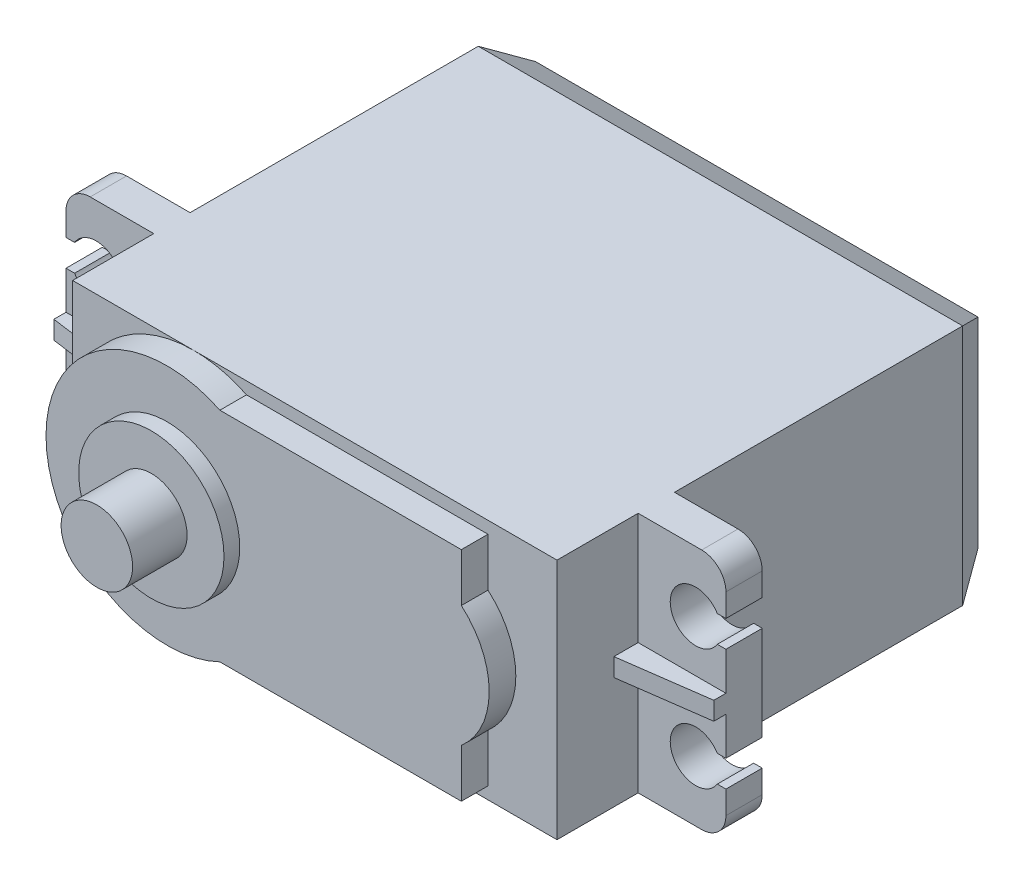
ISO-10303-21;
HEADER;
FILE_DESCRIPTION(('STEP AP214'),'2;1');
FILE_NAME('part.step','',(''),(''),'','','');
FILE_SCHEMA(('AUTOMOTIVE_DESIGN { 1 0 10303 214 1 1 1 1 }'));
ENDSEC;
DATA;
#1=APPLICATION_CONTEXT('core data for automotive mechanical design processes');
#2=APPLICATION_PROTOCOL_DEFINITION('international standard','automotive_design',2000,#1);
#3=PRODUCT_CONTEXT('',#1,'mechanical');
#4=PRODUCT('Part','Part','',(#3));
#5=PRODUCT_RELATED_PRODUCT_CATEGORY('part','',(#4));
#6=PRODUCT_DEFINITION_FORMATION('','',#4);
#7=PRODUCT_DEFINITION_CONTEXT('part definition',#1,'design');
#8=PRODUCT_DEFINITION('design','',#6,#7);
#9=PRODUCT_DEFINITION_SHAPE('','',#8);
#10=(LENGTH_UNIT() NAMED_UNIT(*) SI_UNIT(.MILLI.,.METRE.));
#11=(NAMED_UNIT(*) PLANE_ANGLE_UNIT() SI_UNIT($,.RADIAN.));
#12=(NAMED_UNIT(*) SI_UNIT($,.STERADIAN.) SOLID_ANGLE_UNIT());
#13=UNCERTAINTY_MEASURE_WITH_UNIT(LENGTH_MEASURE(1.E-05),#10,'distance_accuracy_value','');
#14=(GEOMETRIC_REPRESENTATION_CONTEXT(3) GLOBAL_UNCERTAINTY_ASSIGNED_CONTEXT((#13)) GLOBAL_UNIT_ASSIGNED_CONTEXT((#10,
#11,#12)) REPRESENTATION_CONTEXT('',''));
#15=CARTESIAN_POINT('',(0.,0.,0.));
#16=DIRECTION('',(0.,0.,1.));
#17=DIRECTION('',(1.,0.,0.));
#18=AXIS2_PLACEMENT_3D('',#15,#16,#17);
#19=CARTESIAN_POINT('',(-9.99999999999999,0.,40.));
#20=DIRECTION('',(0.,0.,1.));
#21=DIRECTION('',(1.,0.,0.));
#22=AXIS2_PLACEMENT_3D('',#19,#20,#21);
#23=PLANE('',#22);
#24=CARTESIAN_POINT('',(-9.99999999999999,0.,40.));
#25=DIRECTION('',(0.,0.,1.));
#26=DIRECTION('',(1.,0.,0.));
#27=AXIS2_PLACEMENT_3D('',#24,#25,#26);
#28=CIRCLE('',#27,6.);
#29=CARTESIAN_POINT('',(-3.99999999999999,0.,40.));
#30=VERTEX_POINT('',#29);
#31=EDGE_CURVE('E1238',#30,#30,#28,.T.);
#32=ORIENTED_EDGE('',*,*,#31,.T.);
#33=EDGE_LOOP('',(#32));
#34=FACE_BOUND('',#33,.T.);
#35=CARTESIAN_POINT('',(-9.99999999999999,0.,40.));
#36=DIRECTION('',(0.,0.,1.));
#37=DIRECTION('',(1.,0.,0.));
#38=AXIS2_PLACEMENT_3D('',#35,#36,#37);
#39=CIRCLE('',#38,2.95);
#40=CARTESIAN_POINT('',(-7.04999999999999,0.,40.));
#41=VERTEX_POINT('',#40);
#42=EDGE_CURVE('E1235',#41,#41,#39,.T.);
#43=ORIENTED_EDGE('',*,*,#42,.F.);
#44=EDGE_LOOP('',(#43));
#45=FACE_BOUND('',#44,.T.);
#46=ADVANCED_FACE('F32',(#34,#45),#23,.T.);
#47=CARTESIAN_POINT('',(-9.99999999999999,0.,38.7));
#48=DIRECTION('',(0.,0.,1.));
#49=DIRECTION('',(1.,0.,0.));
#50=AXIS2_PLACEMENT_3D('',#47,#48,#49);
#51=PLANE('',#50);
#52=DIRECTION('',(0.,1.,0.));
#53=VECTOR('',#52,1.);
#54=CARTESIAN_POINT('',(14.3,-5.,38.7));
#55=LINE('',#54,#53);
#56=CARTESIAN_POINT('',(14.3,-9.,38.7));
#57=VERTEX_POINT('',#56);
#58=CARTESIAN_POINT('',(14.3,-5.,38.7));
#59=VERTEX_POINT('',#58);
#60=EDGE_CURVE('E358',#57,#59,#55,.T.);
#61=ORIENTED_EDGE('',*,*,#60,.T.);
#62=CARTESIAN_POINT('',(10.0152173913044,0.,38.7));
#63=DIRECTION('',(0.,0.,1.));
#64=DIRECTION('',(1.,0.,0.));
#65=AXIS2_PLACEMENT_3D('',#62,#63,#64);
#66=CIRCLE('',#65,6.58478260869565);
#67=CARTESIAN_POINT('',(14.3,5.,38.7));
#68=VERTEX_POINT('',#67);
#69=EDGE_CURVE('E347',#59,#68,#66,.T.);
#70=ORIENTED_EDGE('',*,*,#69,.T.);
#71=DIRECTION('',(0.,1.,0.));
#72=VECTOR('',#71,1.);
#73=CARTESIAN_POINT('',(14.3,9.,38.7));
#74=LINE('',#73,#72);
#75=CARTESIAN_POINT('',(14.3,9.,38.7));
#76=VERTEX_POINT('',#75);
#77=EDGE_CURVE('E357',#68,#76,#74,.T.);
#78=ORIENTED_EDGE('',*,*,#77,.T.);
#79=DIRECTION('',(-1.,0.,0.));
#80=VECTOR('',#79,1.);
#81=CARTESIAN_POINT('',(-5.64110105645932,9.,38.7));
#82=LINE('',#81,#80);
#83=CARTESIAN_POINT('',(-5.64110105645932,9.,38.7));
#84=VERTEX_POINT('',#83);
#85=EDGE_CURVE('E1245',#76,#84,#82,.T.);
#86=ORIENTED_EDGE('',*,*,#85,.T.);
#87=CARTESIAN_POINT('',(-9.99999999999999,0.,38.7));
#88=DIRECTION('',(0.,0.,1.));
#89=DIRECTION('',(1.,0.,0.));
#90=AXIS2_PLACEMENT_3D('',#87,#88,#89);
#91=CIRCLE('',#90,10.);
#92=CARTESIAN_POINT('',(-5.6411010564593,-9.,38.7));
#93=VERTEX_POINT('',#92);
#94=EDGE_CURVE('E1247',#84,#93,#91,.T.);
#95=ORIENTED_EDGE('',*,*,#94,.T.);
#96=DIRECTION('',(1.,0.,0.));
#97=VECTOR('',#96,1.);
#98=CARTESIAN_POINT('',(-5.6411010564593,-9.,38.7));
#99=LINE('',#98,#97);
#100=EDGE_CURVE('E364',#93,#57,#99,.T.);
#101=ORIENTED_EDGE('',*,*,#100,.T.);
#102=EDGE_LOOP('',(#61,#70,#78,#86,#95,#101));
#103=FACE_BOUND('',#102,.T.);
#104=CARTESIAN_POINT('',(-9.99999999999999,0.,38.7));
#105=DIRECTION('',(0.,0.,1.));
#106=DIRECTION('',(1.,0.,0.));
#107=AXIS2_PLACEMENT_3D('',#104,#105,#106);
#108=CIRCLE('',#107,6.);
#109=CARTESIAN_POINT('',(-3.99999999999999,0.,38.7));
#110=VERTEX_POINT('',#109);
#111=EDGE_CURVE('E1234',#110,#110,#108,.T.);
#112=ORIENTED_EDGE('',*,*,#111,.F.);
#113=EDGE_LOOP('',(#112));
#114=FACE_BOUND('',#113,.T.);
#115=ADVANCED_FACE('F361',(#103,#114),#51,.T.);
#116=CARTESIAN_POINT('',(0.,0.,36.5));
#117=DIRECTION('',(0.,0.,1.));
#118=DIRECTION('',(1.,0.,0.));
#119=AXIS2_PLACEMENT_3D('',#116,#117,#118);
#120=PLANE('',#119);
#121=CARTESIAN_POINT('',(-9.99999999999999,0.,36.5));
#122=DIRECTION('',(0.,0.,1.));
#123=DIRECTION('',(1.,0.,0.));
#124=AXIS2_PLACEMENT_3D('',#121,#122,#123);
#125=CIRCLE('',#124,10.);
#126=CARTESIAN_POINT('',(-20.,0.,36.5));
#127=VERTEX_POINT('',#126);
#128=CARTESIAN_POINT('',(-9.99999999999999,-10.,36.5));
#129=VERTEX_POINT('',#128);
#130=EDGE_CURVE('E11',#127,#129,#125,.T.);
#131=ORIENTED_EDGE('',*,*,#130,.F.);
#132=DIRECTION('',(0.,-1.,0.));
#133=VECTOR('',#132,1.);
#134=CARTESIAN_POINT('',(-20.,-10.,36.5));
#135=LINE('',#134,#133);
#136=CARTESIAN_POINT('',(-20.,-10.,36.5));
#137=VERTEX_POINT('',#136);
#138=EDGE_CURVE('E740',#127,#137,#135,.T.);
#139=ORIENTED_EDGE('',*,*,#138,.T.);
#140=DIRECTION('',(1.,0.,0.));
#141=VECTOR('',#140,1.);
#142=CARTESIAN_POINT('',(20.,-10.,36.5));
#143=LINE('',#142,#141);
#144=EDGE_CURVE('E735',#137,#129,#143,.T.);
#145=ORIENTED_EDGE('',*,*,#144,.T.);
#146=EDGE_LOOP('',(#131,#139,#145));
#147=FACE_BOUND('',#146,.T.);
#148=ADVANCED_FACE('F843',(#147),#120,.T.);
#149=CARTESIAN_POINT('',(-5.6411010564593,-9.,36.5));
#150=VERTEX_POINT('',#149);
#151=EDGE_CURVE('E41',#129,#150,#125,.T.);
#152=ORIENTED_EDGE('',*,*,#151,.F.);
#153=CARTESIAN_POINT('',(20.,-10.,36.5));
#154=VERTEX_POINT('',#153);
#155=EDGE_CURVE('E697',#129,#154,#143,.T.);
#156=ORIENTED_EDGE('',*,*,#155,.T.);
#157=DIRECTION('',(0.,1.,0.));
#158=VECTOR('',#157,1.);
#159=CARTESIAN_POINT('',(20.,-10.,36.5));
#160=LINE('',#159,#158);
#161=CARTESIAN_POINT('',(20.,10.,36.5));
#162=VERTEX_POINT('',#161);
#163=EDGE_CURVE('E693',#154,#162,#160,.T.);
#164=ORIENTED_EDGE('',*,*,#163,.T.);
#165=DIRECTION('',(-1.,0.,0.));
#166=VECTOR('',#165,1.);
#167=CARTESIAN_POINT('',(20.,10.,36.5));
#168=LINE('',#167,#166);
#169=CARTESIAN_POINT('',(-9.99999999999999,9.99999999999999,36.5));
#170=VERTEX_POINT('',#169);
#171=EDGE_CURVE('E729',#162,#170,#168,.T.);
#172=ORIENTED_EDGE('',*,*,#171,.T.);
#173=CARTESIAN_POINT('',(-5.64110105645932,9.,36.5));
#174=VERTEX_POINT('',#173);
#175=EDGE_CURVE('E43',#174,#170,#125,.T.);
#176=ORIENTED_EDGE('',*,*,#175,.F.);
#177=DIRECTION('',(-1.,0.,0.));
#178=VECTOR('',#177,1.);
#179=CARTESIAN_POINT('',(-5.64110105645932,9.,36.5));
#180=LINE('',#179,#178);
#181=CARTESIAN_POINT('',(14.3,9.,36.5));
#182=VERTEX_POINT('',#181);
#183=EDGE_CURVE('E1257',#182,#174,#180,.T.);
#184=ORIENTED_EDGE('',*,*,#183,.F.);
#185=DIRECTION('',(0.,1.,0.));
#186=VECTOR('',#185,1.);
#187=CARTESIAN_POINT('',(14.3,9.,36.5));
#188=LINE('',#187,#186);
#189=CARTESIAN_POINT('',(14.3,5.,36.5));
#190=VERTEX_POINT('',#189);
#191=EDGE_CURVE('E1254',#190,#182,#188,.T.);
#192=ORIENTED_EDGE('',*,*,#191,.F.);
#193=CARTESIAN_POINT('',(10.0152173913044,0.,36.5));
#194=DIRECTION('',(0.,0.,1.));
#195=DIRECTION('',(1.,0.,0.));
#196=AXIS2_PLACEMENT_3D('',#193,#194,#195);
#197=CIRCLE('',#196,6.58478260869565);
#198=CARTESIAN_POINT('',(14.3,-5.,36.5));
#199=VERTEX_POINT('',#198);
#200=EDGE_CURVE('E1252',#199,#190,#197,.T.);
#201=ORIENTED_EDGE('',*,*,#200,.F.);
#202=DIRECTION('',(0.,1.,0.));
#203=VECTOR('',#202,1.);
#204=CARTESIAN_POINT('',(14.3,-5.,36.5));
#205=LINE('',#204,#203);
#206=CARTESIAN_POINT('',(14.3,-9.,36.5));
#207=VERTEX_POINT('',#206);
#208=EDGE_CURVE('E55',#207,#199,#205,.T.);
#209=ORIENTED_EDGE('',*,*,#208,.F.);
#210=DIRECTION('',(1.,0.,0.));
#211=VECTOR('',#210,1.);
#212=CARTESIAN_POINT('',(-5.6411010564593,-9.,36.5));
#213=LINE('',#212,#211);
#214=EDGE_CURVE('E50',#150,#207,#213,.T.);
#215=ORIENTED_EDGE('',*,*,#214,.F.);
#216=EDGE_LOOP('',(#152,#156,#164,#172,#176,#184,#192,#201,#209,#215));
#217=FACE_BOUND('',#216,.T.);
#218=ADVANCED_FACE('F952',(#217),#120,.T.);
#219=CARTESIAN_POINT('',(20.,-10.,36.5));
#220=DIRECTION('',(-1.,0.,0.));
#221=DIRECTION('',(0.,0.,1.));
#222=AXIS2_PLACEMENT_3D('',#219,#220,#221);
#223=PLANE('',#222);
#224=DIRECTION('',(0.,0.,1.));
#225=VECTOR('',#224,1.);
#226=CARTESIAN_POINT('',(20.,-0.749999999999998,31.8));
#227=LINE('',#226,#225);
#228=CARTESIAN_POINT('',(20.,-0.749999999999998,29.8));
#229=VERTEX_POINT('',#228);
#230=CARTESIAN_POINT('',(20.,-0.749999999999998,31.8));
#231=VERTEX_POINT('',#230);
#232=EDGE_CURVE('E393',#229,#231,#227,.T.);
#233=ORIENTED_EDGE('',*,*,#232,.T.);
#234=DIRECTION('',(0.,1.,0.));
#235=VECTOR('',#234,1.);
#236=CARTESIAN_POINT('',(20.,-0.749999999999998,31.8));
#237=LINE('',#236,#235);
#238=CARTESIAN_POINT('',(20.,0.750000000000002,31.8));
#239=VERTEX_POINT('',#238);
#240=EDGE_CURVE('E399',#231,#239,#237,.T.);
#241=ORIENTED_EDGE('',*,*,#240,.T.);
#242=DIRECTION('',(0.,0.,1.));
#243=VECTOR('',#242,1.);
#244=CARTESIAN_POINT('',(20.,0.750000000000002,31.8));
#245=LINE('',#244,#243);
#246=CARTESIAN_POINT('',(20.,0.750000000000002,29.8));
#247=VERTEX_POINT('',#246);
#248=EDGE_CURVE('E382',#247,#239,#245,.T.);
#249=ORIENTED_EDGE('',*,*,#248,.F.);
#250=DIRECTION('',(0.,1.,0.));
#251=VECTOR('',#250,1.);
#252=CARTESIAN_POINT('',(20.,10.,29.8));
#253=LINE('',#252,#251);
#254=CARTESIAN_POINT('',(20.,10.,29.8));
#255=VERTEX_POINT('',#254);
#256=EDGE_CURVE('E448',#247,#255,#253,.T.);
#257=ORIENTED_EDGE('',*,*,#256,.T.);
#258=DIRECTION('',(0.,0.,-1.));
#259=VECTOR('',#258,1.);
#260=CARTESIAN_POINT('',(20.,10.,36.5));
#261=LINE('',#260,#259);
#262=EDGE_CURVE('E566',#162,#255,#261,.T.);
#263=ORIENTED_EDGE('',*,*,#262,.F.);
#264=ORIENTED_EDGE('',*,*,#163,.F.);
#265=DIRECTION('',(0.,0.,-1.));
#266=VECTOR('',#265,1.);
#267=CARTESIAN_POINT('',(20.,-10.,36.5));
#268=LINE('',#267,#266);
#269=CARTESIAN_POINT('',(20.,-10.,29.8));
#270=VERTEX_POINT('',#269);
#271=EDGE_CURVE('E576',#154,#270,#268,.T.);
#272=ORIENTED_EDGE('',*,*,#271,.T.);
#273=EDGE_CURVE('E451',#270,#229,#253,.T.);
#274=ORIENTED_EDGE('',*,*,#273,.T.);
#275=EDGE_LOOP('',(#233,#241,#249,#257,#263,#264,#272,#274));
#276=FACE_BOUND('',#275,.T.);
#277=ADVANCED_FACE('F690',(#276),#223,.F.);
#278=CARTESIAN_POINT('',(24.75,-5.,29.8));
#279=DIRECTION('',(0.,0.,-1.));
#280=DIRECTION('',(-1.,0.,0.));
#281=AXIS2_PLACEMENT_3D('',#278,#279,#280);
#282=PLANE('',#281);
#283=DIRECTION('',(-1.,0.,0.));
#284=VECTOR('',#283,1.);
#285=CARTESIAN_POINT('',(20.,-0.749999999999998,29.8));
#286=LINE('',#285,#284);
#287=CARTESIAN_POINT('',(27.25,-0.749999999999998,29.8));
#288=VERTEX_POINT('',#287);
#289=EDGE_CURVE('E390',#288,#229,#286,.T.);
#290=ORIENTED_EDGE('',*,*,#289,.T.);
#291=ORIENTED_EDGE('',*,*,#273,.F.);
#292=DIRECTION('',(-1.,0.,0.));
#293=VECTOR('',#292,1.);
#294=CARTESIAN_POINT('',(20.,-10.,29.8));
#295=LINE('',#294,#293);
#296=CARTESIAN_POINT('',(25.25,-10.,29.8));
#297=VERTEX_POINT('',#296);
#298=EDGE_CURVE('E481',#297,#270,#295,.T.);
#299=ORIENTED_EDGE('',*,*,#298,.F.);
#300=CARTESIAN_POINT('',(25.25,-8.,29.8));
#301=DIRECTION('',(0.,0.,-1.));
#302=DIRECTION('',(-1.,0.,0.));
#303=AXIS2_PLACEMENT_3D('',#300,#301,#302);
#304=CIRCLE('',#303,2.);
#305=CARTESIAN_POINT('',(27.25,-8.,29.8));
#306=VERTEX_POINT('',#305);
#307=EDGE_CURVE('E488',#297,#306,#304,.F.);
#308=ORIENTED_EDGE('',*,*,#307,.T.);
#309=DIRECTION('',(0.,-1.,0.));
#310=VECTOR('',#309,1.);
#311=CARTESIAN_POINT('',(27.25,-6.1,29.8));
#312=LINE('',#311,#310);
#313=CARTESIAN_POINT('',(27.25,-6.1,29.8));
#314=VERTEX_POINT('',#313);
#315=EDGE_CURVE('E485',#314,#306,#312,.T.);
#316=ORIENTED_EDGE('',*,*,#315,.F.);
#317=DIRECTION('',(1.,0.,0.));
#318=VECTOR('',#317,1.);
#319=CARTESIAN_POINT('',(27.25,-6.1,29.8));
#320=LINE('',#319,#318);
#321=CARTESIAN_POINT('',(26.5388543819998,-6.1,29.8));
#322=VERTEX_POINT('',#321);
#323=EDGE_CURVE('E781',#322,#314,#320,.T.);
#324=ORIENTED_EDGE('',*,*,#323,.F.);
#325=CARTESIAN_POINT('',(24.75,-5.,29.8));
#326=DIRECTION('',(0.,0.,1.));
#327=DIRECTION('',(-1.,0.,0.));
#328=AXIS2_PLACEMENT_3D('',#325,#326,#327);
#329=CIRCLE('',#328,2.1);
#330=CARTESIAN_POINT('',(26.5388543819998,-3.9,29.8));
#331=VERTEX_POINT('',#330);
#332=EDGE_CURVE('E784',#331,#322,#329,.T.);
#333=ORIENTED_EDGE('',*,*,#332,.F.);
#334=DIRECTION('',(-1.,0.,0.));
#335=VECTOR('',#334,1.);
#336=CARTESIAN_POINT('',(27.25,-3.9,29.8));
#337=LINE('',#336,#335);
#338=CARTESIAN_POINT('',(27.25,-3.9,29.8));
#339=VERTEX_POINT('',#338);
#340=EDGE_CURVE('E787',#339,#331,#337,.T.);
#341=ORIENTED_EDGE('',*,*,#340,.F.);
#342=DIRECTION('',(0.,-1.,0.));
#343=VECTOR('',#342,1.);
#344=CARTESIAN_POINT('',(27.25,3.9,29.8));
#345=LINE('',#344,#343);
#346=EDGE_CURVE('E707',#288,#339,#345,.T.);
#347=ORIENTED_EDGE('',*,*,#346,.F.);
#348=EDGE_LOOP('',(#290,#291,#299,#308,#316,#324,#333,#341,#347));
#349=FACE_BOUND('',#348,.T.);
#350=ADVANCED_FACE('F704',(#349),#282,.F.);
#351=CARTESIAN_POINT('',(-20.,-10.,36.5));
#352=DIRECTION('',(1.,0.,0.));
#353=DIRECTION('',(0.,0.,-1.));
#354=AXIS2_PLACEMENT_3D('',#351,#352,#353);
#355=PLANE('',#354);
#356=DIRECTION('',(0.,0.,-1.));
#357=VECTOR('',#356,1.);
#358=CARTESIAN_POINT('',(-20.,-0.750000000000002,31.8));
#359=LINE('',#358,#357);
#360=CARTESIAN_POINT('',(-20.,-0.750000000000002,31.8));
#361=VERTEX_POINT('',#360);
#362=CARTESIAN_POINT('',(-20.,-0.750000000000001,29.8));
#363=VERTEX_POINT('',#362);
#364=EDGE_CURVE('E424',#361,#363,#359,.T.);
#365=ORIENTED_EDGE('',*,*,#364,.T.);
#366=DIRECTION('',(0.,-1.,0.));
#367=VECTOR('',#366,1.);
#368=CARTESIAN_POINT('',(-20.,10.,29.8));
#369=LINE('',#368,#367);
#370=CARTESIAN_POINT('',(-20.,-10.,29.8));
#371=VERTEX_POINT('',#370);
#372=EDGE_CURVE('E442',#363,#371,#369,.T.);
#373=ORIENTED_EDGE('',*,*,#372,.T.);
#374=DIRECTION('',(0.,0.,-1.));
#375=VECTOR('',#374,1.);
#376=CARTESIAN_POINT('',(-20.,-10.,36.5));
#377=LINE('',#376,#375);
#378=EDGE_CURVE('E589',#137,#371,#377,.T.);
#379=ORIENTED_EDGE('',*,*,#378,.F.);
#380=ORIENTED_EDGE('',*,*,#138,.F.);
#381=CARTESIAN_POINT('',(-20.,9.99999999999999,36.5));
#382=VERTEX_POINT('',#381);
#383=EDGE_CURVE('E737',#382,#127,#135,.T.);
#384=ORIENTED_EDGE('',*,*,#383,.F.);
#385=DIRECTION('',(0.,0.,-1.));
#386=VECTOR('',#385,1.);
#387=CARTESIAN_POINT('',(-20.,9.99999999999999,36.5));
#388=LINE('',#387,#386);
#389=CARTESIAN_POINT('',(-20.,10.,29.8));
#390=VERTEX_POINT('',#389);
#391=EDGE_CURVE('E567',#382,#390,#388,.T.);
#392=ORIENTED_EDGE('',*,*,#391,.T.);
#393=CARTESIAN_POINT('',(-20.,0.749999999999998,29.8));
#394=VERTEX_POINT('',#393);
#395=EDGE_CURVE('E438',#390,#394,#369,.T.);
#396=ORIENTED_EDGE('',*,*,#395,.T.);
#397=DIRECTION('',(0.,0.,-1.));
#398=VECTOR('',#397,1.);
#399=CARTESIAN_POINT('',(-20.,0.749999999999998,31.8));
#400=LINE('',#399,#398);
#401=CARTESIAN_POINT('',(-20.,0.749999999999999,31.8));
#402=VERTEX_POINT('',#401);
#403=EDGE_CURVE('E413',#402,#394,#400,.T.);
#404=ORIENTED_EDGE('',*,*,#403,.F.);
#405=DIRECTION('',(0.,1.,0.));
#406=VECTOR('',#405,1.);
#407=CARTESIAN_POINT('',(-20.,-0.750000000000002,31.8));
#408=LINE('',#407,#406);
#409=EDGE_CURVE('E427',#361,#402,#408,.T.);
#410=ORIENTED_EDGE('',*,*,#409,.F.);
#411=EDGE_LOOP('',(#365,#373,#379,#380,#384,#392,#396,#404,#410));
#412=FACE_BOUND('',#411,.T.);
#413=ADVANCED_FACE('F961',(#412),#355,.F.);
#414=CARTESIAN_POINT('',(-24.75,-5.,29.8));
#415=DIRECTION('',(0.,0.,1.));
#416=DIRECTION('',(1.,0.,0.));
#417=AXIS2_PLACEMENT_3D('',#414,#415,#416);
#418=PLANE('',#417);
#419=ORIENTED_EDGE('',*,*,#372,.F.);
#420=DIRECTION('',(-1.,0.,0.));
#421=VECTOR('',#420,1.);
#422=CARTESIAN_POINT('',(-20.,-0.750000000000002,29.8));
#423=LINE('',#422,#421);
#424=CARTESIAN_POINT('',(-27.25,-0.750000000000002,29.8));
#425=VERTEX_POINT('',#424);
#426=EDGE_CURVE('E416',#363,#425,#423,.T.);
#427=ORIENTED_EDGE('',*,*,#426,.T.);
#428=DIRECTION('',(0.,1.,0.));
#429=VECTOR('',#428,1.);
#430=CARTESIAN_POINT('',(-27.25,3.9,29.8));
#431=LINE('',#430,#429);
#432=CARTESIAN_POINT('',(-27.25,-3.9,29.8));
#433=VERTEX_POINT('',#432);
#434=EDGE_CURVE('E1289',#433,#425,#431,.T.);
#435=ORIENTED_EDGE('',*,*,#434,.F.);
#436=DIRECTION('',(-1.,0.,0.));
#437=VECTOR('',#436,1.);
#438=CARTESIAN_POINT('',(-27.25,-3.9,29.8));
#439=LINE('',#438,#437);
#440=CARTESIAN_POINT('',(-26.5388543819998,-3.9,29.8));
#441=VERTEX_POINT('',#440);
#442=EDGE_CURVE('E1299',#441,#433,#439,.T.);
#443=ORIENTED_EDGE('',*,*,#442,.F.);
#444=CARTESIAN_POINT('',(-24.75,-5.,29.8));
#445=DIRECTION('',(0.,0.,1.));
#446=DIRECTION('',(1.,0.,0.));
#447=AXIS2_PLACEMENT_3D('',#444,#445,#446);
#448=CIRCLE('',#447,2.1);
#449=CARTESIAN_POINT('',(-26.5388543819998,-6.1,29.8));
#450=VERTEX_POINT('',#449);
#451=EDGE_CURVE('E1349',#450,#441,#448,.T.);
#452=ORIENTED_EDGE('',*,*,#451,.F.);
#453=DIRECTION('',(1.,0.,0.));
#454=VECTOR('',#453,1.);
#455=CARTESIAN_POINT('',(-27.25,-6.1,29.8));
#456=LINE('',#455,#454);
#457=CARTESIAN_POINT('',(-27.25,-6.1,29.8));
#458=VERTEX_POINT('',#457);
#459=EDGE_CURVE('E1345',#458,#450,#456,.T.);
#460=ORIENTED_EDGE('',*,*,#459,.F.);
#461=DIRECTION('',(0.,1.,0.));
#462=VECTOR('',#461,1.);
#463=CARTESIAN_POINT('',(-27.25,-6.1,29.8));
#464=LINE('',#463,#462);
#465=CARTESIAN_POINT('',(-27.25,-8.00000000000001,29.8));
#466=VERTEX_POINT('',#465);
#467=EDGE_CURVE('E434',#466,#458,#464,.T.);
#468=ORIENTED_EDGE('',*,*,#467,.F.);
#469=CARTESIAN_POINT('',(-25.25,-8.00000000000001,29.8));
#470=DIRECTION('',(0.,0.,1.));
#471=DIRECTION('',(1.,0.,0.));
#472=AXIS2_PLACEMENT_3D('',#469,#470,#471);
#473=CIRCLE('',#472,2.);
#474=CARTESIAN_POINT('',(-25.25,-10.,29.8));
#475=VERTEX_POINT('',#474);
#476=EDGE_CURVE('E629',#466,#475,#473,.T.);
#477=ORIENTED_EDGE('',*,*,#476,.T.);
#478=DIRECTION('',(-1.,0.,0.));
#479=VECTOR('',#478,1.);
#480=CARTESIAN_POINT('',(-20.,-10.,29.8));
#481=LINE('',#480,#479);
#482=EDGE_CURVE('E1278',#371,#475,#481,.T.);
#483=ORIENTED_EDGE('',*,*,#482,.F.);
#484=EDGE_LOOP('',(#419,#427,#435,#443,#452,#460,#468,#477,#483));
#485=FACE_BOUND('',#484,.T.);
#486=ADVANCED_FACE('F891',(#485),#418,.T.);
#487=CARTESIAN_POINT('',(-20.,10.,26.8));
#488=VERTEX_POINT('',#487);
#489=CARTESIAN_POINT('',(-20.,9.99999999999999,3.00000000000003));
#490=VERTEX_POINT('',#489);
#491=EDGE_CURVE('E572',#488,#490,#388,.T.);
#492=ORIENTED_EDGE('',*,*,#491,.T.);
#493=DIRECTION('',(0.,-1.,0.));
#494=VECTOR('',#493,1.);
#495=CARTESIAN_POINT('',(-20.,-10.,3.00000000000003));
#496=LINE('',#495,#494);
#497=CARTESIAN_POINT('',(-20.,-10.,3.00000000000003));
#498=VERTEX_POINT('',#497);
#499=EDGE_CURVE('E529',#490,#498,#496,.T.);
#500=ORIENTED_EDGE('',*,*,#499,.T.);
#501=CARTESIAN_POINT('',(-20.,-10.,26.8));
#502=VERTEX_POINT('',#501);
#503=EDGE_CURVE('E587',#502,#498,#377,.T.);
#504=ORIENTED_EDGE('',*,*,#503,.F.);
#505=DIRECTION('',(0.,-1.,0.));
#506=VECTOR('',#505,1.);
#507=CARTESIAN_POINT('',(-20.,10.,26.8));
#508=LINE('',#507,#506);
#509=EDGE_CURVE('E430',#488,#502,#508,.T.);
#510=ORIENTED_EDGE('',*,*,#509,.F.);
#511=EDGE_LOOP('',(#492,#500,#504,#510));
#512=FACE_BOUND('',#511,.T.);
#513=ADVANCED_FACE('F685',(#512),#355,.F.);
#514=CARTESIAN_POINT('',(20.,-10.,26.8));
#515=VERTEX_POINT('',#514);
#516=CARTESIAN_POINT('',(20.,-10.,3.00000000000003));
#517=VERTEX_POINT('',#516);
#518=EDGE_CURVE('E468',#515,#517,#268,.T.);
#519=ORIENTED_EDGE('',*,*,#518,.T.);
#520=DIRECTION('',(0.,1.,0.));
#521=VECTOR('',#520,1.);
#522=CARTESIAN_POINT('',(20.,-10.,3.00000000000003));
#523=LINE('',#522,#521);
#524=CARTESIAN_POINT('',(20.,10.,3.00000000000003));
#525=VERTEX_POINT('',#524);
#526=EDGE_CURVE('E525',#517,#525,#523,.T.);
#527=ORIENTED_EDGE('',*,*,#526,.T.);
#528=CARTESIAN_POINT('',(20.,10.,26.8));
#529=VERTEX_POINT('',#528);
#530=EDGE_CURVE('E557',#529,#525,#261,.T.);
#531=ORIENTED_EDGE('',*,*,#530,.F.);
#532=DIRECTION('',(0.,1.,0.));
#533=VECTOR('',#532,1.);
#534=CARTESIAN_POINT('',(20.,10.,26.8));
#535=LINE('',#534,#533);
#536=EDGE_CURVE('E477',#515,#529,#535,.T.);
#537=ORIENTED_EDGE('',*,*,#536,.F.);
#538=EDGE_LOOP('',(#519,#527,#531,#537));
#539=FACE_BOUND('',#538,.T.);
#540=ADVANCED_FACE('F555',(#539),#223,.F.);
#541=CARTESIAN_POINT('',(20.,-10.,36.5));
#542=DIRECTION('',(0.,1.,0.));
#543=DIRECTION('',(-1.,0.,0.));
#544=AXIS2_PLACEMENT_3D('',#541,#542,#543);
#545=PLANE('',#544);
#546=ORIENTED_EDGE('',*,*,#503,.T.);
#547=DIRECTION('',(1.,0.,0.));
#548=VECTOR('',#547,1.);
#549=CARTESIAN_POINT('',(20.,-10.,3.00000000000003));
#550=LINE('',#549,#548);
#551=EDGE_CURVE('E453',#498,#517,#550,.T.);
#552=ORIENTED_EDGE('',*,*,#551,.T.);
#553=ORIENTED_EDGE('',*,*,#518,.F.);
#554=DIRECTION('',(-1.,0.,0.));
#555=VECTOR('',#554,1.);
#556=CARTESIAN_POINT('',(20.,-10.,26.8));
#557=LINE('',#556,#555);
#558=CARTESIAN_POINT('',(25.25,-10.,26.8));
#559=VERTEX_POINT('',#558);
#560=EDGE_CURVE('E452',#559,#515,#557,.T.);
#561=ORIENTED_EDGE('',*,*,#560,.F.);
#562=DIRECTION('',(0.,0.,-1.));
#563=VECTOR('',#562,1.);
#564=CARTESIAN_POINT('',(25.25,-10.,29.8));
#565=LINE('',#564,#563);
#566=EDGE_CURVE('E492',#559,#297,#565,.F.);
#567=ORIENTED_EDGE('',*,*,#566,.T.);
#568=ORIENTED_EDGE('',*,*,#298,.T.);
#569=ORIENTED_EDGE('',*,*,#271,.F.);
#570=ORIENTED_EDGE('',*,*,#155,.F.);
#571=ORIENTED_EDGE('',*,*,#144,.F.);
#572=ORIENTED_EDGE('',*,*,#378,.T.);
#573=ORIENTED_EDGE('',*,*,#482,.T.);
#574=DIRECTION('',(0.,0.,-1.));
#575=VECTOR('',#574,1.);
#576=CARTESIAN_POINT('',(-25.25,-10.,26.8));
#577=LINE('',#576,#575);
#578=CARTESIAN_POINT('',(-25.25,-10.,26.8));
#579=VERTEX_POINT('',#578);
#580=EDGE_CURVE('E494',#475,#579,#577,.T.);
#581=ORIENTED_EDGE('',*,*,#580,.T.);
#582=DIRECTION('',(-1.,0.,0.));
#583=VECTOR('',#582,1.);
#584=CARTESIAN_POINT('',(-20.,-10.,26.8));
#585=LINE('',#584,#583);
#586=EDGE_CURVE('E673',#502,#579,#585,.T.);
#587=ORIENTED_EDGE('',*,*,#586,.F.);
#588=EDGE_LOOP('',(#546,#552,#553,#561,#567,#568,#569,#570,#571,#572,#573,#581,#587));
#589=FACE_BOUND('',#588,.T.);
#590=ADVANCED_FACE('F695',(#589),#545,.F.);
#591=CARTESIAN_POINT('',(20.,10.,36.5));
#592=DIRECTION('',(0.,-1.,0.));
#593=DIRECTION('',(1.,0.,0.));
#594=AXIS2_PLACEMENT_3D('',#591,#592,#593);
#595=PLANE('',#594);
#596=ORIENTED_EDGE('',*,*,#530,.T.);
#597=DIRECTION('',(-1.,0.,0.));
#598=VECTOR('',#597,1.);
#599=CARTESIAN_POINT('',(20.,10.,3.00000000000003));
#600=LINE('',#599,#598);
#601=EDGE_CURVE('E527',#525,#490,#600,.T.);
#602=ORIENTED_EDGE('',*,*,#601,.T.);
#603=ORIENTED_EDGE('',*,*,#491,.F.);
#604=DIRECTION('',(1.,0.,0.));
#605=VECTOR('',#604,1.);
#606=CARTESIAN_POINT('',(-20.,10.,26.8));
#607=LINE('',#606,#605);
#608=CARTESIAN_POINT('',(-25.25,10.,26.8));
#609=VERTEX_POINT('',#608);
#610=EDGE_CURVE('E445',#609,#488,#607,.T.);
#611=ORIENTED_EDGE('',*,*,#610,.F.);
#612=DIRECTION('',(0.,0.,-1.));
#613=VECTOR('',#612,1.);
#614=CARTESIAN_POINT('',(-25.25,9.99999999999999,29.8));
#615=LINE('',#614,#613);
#616=CARTESIAN_POINT('',(-25.25,10.,29.8));
#617=VERTEX_POINT('',#616);
#618=EDGE_CURVE('E626',#609,#617,#615,.F.);
#619=ORIENTED_EDGE('',*,*,#618,.T.);
#620=DIRECTION('',(1.,0.,0.));
#621=VECTOR('',#620,1.);
#622=CARTESIAN_POINT('',(-20.,10.,29.8));
#623=LINE('',#622,#621);
#624=EDGE_CURVE('E634',#617,#390,#623,.T.);
#625=ORIENTED_EDGE('',*,*,#624,.T.);
#626=ORIENTED_EDGE('',*,*,#391,.F.);
#627=EDGE_CURVE('E731',#170,#382,#168,.T.);
#628=ORIENTED_EDGE('',*,*,#627,.F.);
#629=ORIENTED_EDGE('',*,*,#171,.F.);
#630=ORIENTED_EDGE('',*,*,#262,.T.);
#631=DIRECTION('',(1.,0.,0.));
#632=VECTOR('',#631,1.);
#633=CARTESIAN_POINT('',(20.,10.,29.8));
#634=LINE('',#633,#632);
#635=CARTESIAN_POINT('',(25.25,10.,29.8));
#636=VERTEX_POINT('',#635);
#637=EDGE_CURVE('E467',#255,#636,#634,.T.);
#638=ORIENTED_EDGE('',*,*,#637,.T.);
#639=DIRECTION('',(0.,0.,-1.));
#640=VECTOR('',#639,1.);
#641=CARTESIAN_POINT('',(25.25,10.,26.8));
#642=LINE('',#641,#640);
#643=CARTESIAN_POINT('',(25.25,10.,26.8));
#644=VERTEX_POINT('',#643);
#645=EDGE_CURVE('E625',#636,#644,#642,.T.);
#646=ORIENTED_EDGE('',*,*,#645,.T.);
#647=DIRECTION('',(1.,0.,0.));
#648=VECTOR('',#647,1.);
#649=CARTESIAN_POINT('',(20.,10.,26.8));
#650=LINE('',#649,#648);
#651=EDGE_CURVE('E564',#529,#644,#650,.T.);
#652=ORIENTED_EDGE('',*,*,#651,.F.);
#653=EDGE_LOOP('',(#596,#602,#603,#611,#619,#625,#626,#628,#629,#630,#638,#646,#652));
#654=FACE_BOUND('',#653,.T.);
#655=ADVANCED_FACE('F559',(#654),#595,.F.);
#656=EDGE_CURVE('E530',#170,#127,#125,.T.);
#657=ORIENTED_EDGE('',*,*,#656,.F.);
#658=ORIENTED_EDGE('',*,*,#627,.T.);
#659=ORIENTED_EDGE('',*,*,#383,.T.);
#660=EDGE_LOOP('',(#657,#658,#659));
#661=FACE_BOUND('',#660,.T.);
#662=ADVANCED_FACE('F948',(#661),#120,.T.);
#663=CARTESIAN_POINT('',(0.,0.,0.));
#664=DIRECTION('',(0.,0.,1.));
#665=DIRECTION('',(1.,0.,0.));
#666=AXIS2_PLACEMENT_3D('',#663,#664,#665);
#667=PLANE('',#666);
#668=DIRECTION('',(0.,-1.,0.));
#669=VECTOR('',#668,1.);
#670=CARTESIAN_POINT('',(18.2679491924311,0.,0.));
#671=LINE('',#670,#669);
#672=CARTESIAN_POINT('',(18.2679491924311,8.26794919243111,0.));
#673=VERTEX_POINT('',#672);
#674=CARTESIAN_POINT('',(18.2679491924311,-8.26794919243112,0.));
#675=VERTEX_POINT('',#674);
#676=EDGE_CURVE('E519',#673,#675,#671,.T.);
#677=ORIENTED_EDGE('',*,*,#676,.T.);
#678=DIRECTION('',(-1.,0.,0.));
#679=VECTOR('',#678,1.);
#680=CARTESIAN_POINT('',(0.,-8.26794919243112,0.));
#681=LINE('',#680,#679);
#682=CARTESIAN_POINT('',(-18.2679491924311,-8.26794919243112,0.));
#683=VERTEX_POINT('',#682);
#684=EDGE_CURVE('E523',#675,#683,#681,.T.);
#685=ORIENTED_EDGE('',*,*,#684,.T.);
#686=DIRECTION('',(0.,1.,0.));
#687=VECTOR('',#686,1.);
#688=CARTESIAN_POINT('',(-18.2679491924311,0.,0.));
#689=LINE('',#688,#687);
#690=CARTESIAN_POINT('',(-18.2679491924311,8.26794919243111,0.));
#691=VERTEX_POINT('',#690);
#692=EDGE_CURVE('E508',#683,#691,#689,.T.);
#693=ORIENTED_EDGE('',*,*,#692,.T.);
#694=DIRECTION('',(1.,0.,0.));
#695=VECTOR('',#694,1.);
#696=CARTESIAN_POINT('',(0.,8.26794919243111,0.));
#697=LINE('',#696,#695);
#698=EDGE_CURVE('E514',#691,#673,#697,.T.);
#699=ORIENTED_EDGE('',*,*,#698,.T.);
#700=EDGE_LOOP('',(#677,#685,#693,#699));
#701=FACE_BOUND('',#700,.T.);
#702=ADVANCED_FACE('F546',(#701),#667,.F.);
#703=CARTESIAN_POINT('',(27.25,-6.1,29.8));
#704=DIRECTION('',(1.,0.,0.));
#705=DIRECTION('',(0.,0.,-1.));
#706=AXIS2_PLACEMENT_3D('',#703,#704,#705);
#707=PLANE('',#706);
#708=ORIENTED_EDGE('',*,*,#315,.T.);
#709=DIRECTION('',(0.,0.,-1.));
#710=VECTOR('',#709,1.);
#711=CARTESIAN_POINT('',(27.25,-8.,26.8));
#712=LINE('',#711,#710);
#713=CARTESIAN_POINT('',(27.25,-8.,26.8));
#714=VERTEX_POINT('',#713);
#715=EDGE_CURVE('E446',#306,#714,#712,.T.);
#716=ORIENTED_EDGE('',*,*,#715,.T.);
#717=DIRECTION('',(0.,-1.,0.));
#718=VECTOR('',#717,1.);
#719=CARTESIAN_POINT('',(27.25,-6.1,26.8));
#720=LINE('',#719,#718);
#721=CARTESIAN_POINT('',(27.25,-6.1,26.8));
#722=VERTEX_POINT('',#721);
#723=EDGE_CURVE('E600',#722,#714,#720,.T.);
#724=ORIENTED_EDGE('',*,*,#723,.F.);
#725=DIRECTION('',(0.,0.,-1.));
#726=VECTOR('',#725,1.);
#727=CARTESIAN_POINT('',(27.25,-6.1,29.8));
#728=LINE('',#727,#726);
#729=EDGE_CURVE('E754',#314,#722,#728,.T.);
#730=ORIENTED_EDGE('',*,*,#729,.F.);
#731=EDGE_LOOP('',(#708,#716,#724,#730));
#732=FACE_BOUND('',#731,.T.);
#733=ADVANCED_FACE('F819',(#732),#707,.T.);
#734=CARTESIAN_POINT('',(27.25,-6.1,29.8));
#735=DIRECTION('',(0.,1.,0.));
#736=DIRECTION('',(0.,0.,1.));
#737=AXIS2_PLACEMENT_3D('',#734,#735,#736);
#738=PLANE('',#737);
#739=DIRECTION('',(1.,0.,0.));
#740=VECTOR('',#739,1.);
#741=CARTESIAN_POINT('',(27.25,-6.1,26.8));
#742=LINE('',#741,#740);
#743=CARTESIAN_POINT('',(26.5388543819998,-6.1,26.8));
#744=VERTEX_POINT('',#743);
#745=EDGE_CURVE('E757',#744,#722,#742,.T.);
#746=ORIENTED_EDGE('',*,*,#745,.F.);
#747=DIRECTION('',(0.,0.,-1.));
#748=VECTOR('',#747,1.);
#749=CARTESIAN_POINT('',(26.5388543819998,-6.1,29.8));
#750=LINE('',#749,#748);
#751=EDGE_CURVE('E752',#322,#744,#750,.T.);
#752=ORIENTED_EDGE('',*,*,#751,.F.);
#753=ORIENTED_EDGE('',*,*,#323,.T.);
#754=ORIENTED_EDGE('',*,*,#729,.T.);
#755=EDGE_LOOP('',(#746,#752,#753,#754));
#756=FACE_BOUND('',#755,.T.);
#757=ADVANCED_FACE('F818',(#756),#738,.T.);
#758=CARTESIAN_POINT('',(24.75,-5.,29.8));
#759=DIRECTION('',(0.,0.,-1.));
#760=DIRECTION('',(-1.,0.,0.));
#761=AXIS2_PLACEMENT_3D('',#758,#759,#760);
#762=CYLINDRICAL_SURFACE('',#761,2.1);
#763=CARTESIAN_POINT('',(24.75,-5.,26.8));
#764=DIRECTION('',(0.,0.,1.));
#765=DIRECTION('',(-1.,0.,0.));
#766=AXIS2_PLACEMENT_3D('',#763,#764,#765);
#767=CIRCLE('',#766,2.1);
#768=CARTESIAN_POINT('',(26.5388543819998,-3.9,26.8));
#769=VERTEX_POINT('',#768);
#770=EDGE_CURVE('E760',#769,#744,#767,.T.);
#771=ORIENTED_EDGE('',*,*,#770,.F.);
#772=DIRECTION('',(0.,0.,-1.));
#773=VECTOR('',#772,1.);
#774=CARTESIAN_POINT('',(26.5388543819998,-3.9,29.8));
#775=LINE('',#774,#773);
#776=EDGE_CURVE('E750',#331,#769,#775,.T.);
#777=ORIENTED_EDGE('',*,*,#776,.F.);
#778=ORIENTED_EDGE('',*,*,#332,.T.);
#779=ORIENTED_EDGE('',*,*,#751,.T.);
#780=EDGE_LOOP('',(#771,#777,#778,#779));
#781=FACE_BOUND('',#780,.T.);
#782=ADVANCED_FACE('F814',(#781),#762,.F.);
#783=CARTESIAN_POINT('',(27.25,-3.9,29.8));
#784=DIRECTION('',(0.,-1.,0.));
#785=DIRECTION('',(0.,0.,-1.));
#786=AXIS2_PLACEMENT_3D('',#783,#784,#785);
#787=PLANE('',#786);
#788=DIRECTION('',(-1.,0.,0.));
#789=VECTOR('',#788,1.);
#790=CARTESIAN_POINT('',(27.25,-3.9,26.8));
#791=LINE('',#790,#789);
#792=CARTESIAN_POINT('',(27.25,-3.9,26.8));
#793=VERTEX_POINT('',#792);
#794=EDGE_CURVE('E763',#793,#769,#791,.T.);
#795=ORIENTED_EDGE('',*,*,#794,.F.);
#796=DIRECTION('',(0.,0.,-1.));
#797=VECTOR('',#796,1.);
#798=CARTESIAN_POINT('',(27.25,-3.9,29.8));
#799=LINE('',#798,#797);
#800=EDGE_CURVE('E748',#339,#793,#799,.T.);
#801=ORIENTED_EDGE('',*,*,#800,.F.);
#802=ORIENTED_EDGE('',*,*,#340,.T.);
#803=ORIENTED_EDGE('',*,*,#776,.T.);
#804=EDGE_LOOP('',(#795,#801,#802,#803));
#805=FACE_BOUND('',#804,.T.);
#806=ADVANCED_FACE('F811',(#805),#787,.T.);
#807=CARTESIAN_POINT('',(27.25,3.9,29.8));
#808=DIRECTION('',(1.,0.,0.));
#809=DIRECTION('',(0.,1.,0.));
#810=AXIS2_PLACEMENT_3D('',#807,#808,#809);
#811=PLANE('',#810);
#812=DIRECTION('',(0.,-1.,0.));
#813=VECTOR('',#812,1.);
#814=CARTESIAN_POINT('',(27.25,3.9,26.8));
#815=LINE('',#814,#813);
#816=CARTESIAN_POINT('',(27.25,3.9,26.8));
#817=VERTEX_POINT('',#816);
#818=EDGE_CURVE('E766',#817,#793,#815,.T.);
#819=ORIENTED_EDGE('',*,*,#818,.F.);
#820=DIRECTION('',(0.,0.,-1.));
#821=VECTOR('',#820,1.);
#822=CARTESIAN_POINT('',(27.25,3.9,29.8));
#823=LINE('',#822,#821);
#824=CARTESIAN_POINT('',(27.25,3.9,29.8));
#825=VERTEX_POINT('',#824);
#826=EDGE_CURVE('E746',#825,#817,#823,.T.);
#827=ORIENTED_EDGE('',*,*,#826,.F.);
#828=CARTESIAN_POINT('',(27.25,0.750000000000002,29.8));
#829=VERTEX_POINT('',#828);
#830=EDGE_CURVE('E790',#825,#829,#345,.T.);
#831=ORIENTED_EDGE('',*,*,#830,.T.);
#832=DIRECTION('',(0.,0.,-1.));
#833=VECTOR('',#832,1.);
#834=CARTESIAN_POINT('',(27.25,0.750000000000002,29.8));
#835=LINE('',#834,#833);
#836=CARTESIAN_POINT('',(27.25,0.750000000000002,30.8));
#837=VERTEX_POINT('',#836);
#838=EDGE_CURVE('E378',#837,#829,#835,.T.);
#839=ORIENTED_EDGE('',*,*,#838,.F.);
#840=DIRECTION('',(0.,1.,0.));
#841=VECTOR('',#840,1.);
#842=CARTESIAN_POINT('',(27.25,-0.749999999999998,30.8));
#843=LINE('',#842,#841);
#844=CARTESIAN_POINT('',(27.25,-0.749999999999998,30.8));
#845=VERTEX_POINT('',#844);
#846=EDGE_CURVE('E400',#845,#837,#843,.T.);
#847=ORIENTED_EDGE('',*,*,#846,.F.);
#848=DIRECTION('',(0.,0.,-1.));
#849=VECTOR('',#848,1.);
#850=CARTESIAN_POINT('',(27.25,-0.749999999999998,29.8));
#851=LINE('',#850,#849);
#852=EDGE_CURVE('E387',#845,#288,#851,.T.);
#853=ORIENTED_EDGE('',*,*,#852,.T.);
#854=ORIENTED_EDGE('',*,*,#346,.T.);
#855=ORIENTED_EDGE('',*,*,#800,.T.);
#856=EDGE_LOOP('',(#819,#827,#831,#839,#847,#853,#854,#855));
#857=FACE_BOUND('',#856,.T.);
#858=ADVANCED_FACE('F714',(#857),#811,.T.);
#859=CARTESIAN_POINT('',(27.25,3.9,29.8));
#860=DIRECTION('',(0.,1.,0.));
#861=DIRECTION('',(0.,0.,1.));
#862=AXIS2_PLACEMENT_3D('',#859,#860,#861);
#863=PLANE('',#862);
#864=DIRECTION('',(1.,0.,0.));
#865=VECTOR('',#864,1.);
#866=CARTESIAN_POINT('',(27.25,3.9,26.8));
#867=LINE('',#866,#865);
#868=CARTESIAN_POINT('',(26.5388543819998,3.9,26.8));
#869=VERTEX_POINT('',#868);
#870=EDGE_CURVE('E769',#869,#817,#867,.T.);
#871=ORIENTED_EDGE('',*,*,#870,.F.);
#872=DIRECTION('',(0.,0.,-1.));
#873=VECTOR('',#872,1.);
#874=CARTESIAN_POINT('',(26.5388543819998,3.9,29.8));
#875=LINE('',#874,#873);
#876=CARTESIAN_POINT('',(26.5388543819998,3.9,29.8));
#877=VERTEX_POINT('',#876);
#878=EDGE_CURVE('E744',#877,#869,#875,.T.);
#879=ORIENTED_EDGE('',*,*,#878,.F.);
#880=DIRECTION('',(1.,0.,0.));
#881=VECTOR('',#880,1.);
#882=CARTESIAN_POINT('',(27.25,3.9,29.8));
#883=LINE('',#882,#881);
#884=EDGE_CURVE('E792',#877,#825,#883,.T.);
#885=ORIENTED_EDGE('',*,*,#884,.T.);
#886=ORIENTED_EDGE('',*,*,#826,.T.);
#887=EDGE_LOOP('',(#871,#879,#885,#886));
#888=FACE_BOUND('',#887,.T.);
#889=ADVANCED_FACE('F807',(#888),#863,.T.);
#890=CARTESIAN_POINT('',(24.75,5.,29.8));
#891=DIRECTION('',(0.,0.,-1.));
#892=DIRECTION('',(-1.,0.,0.));
#893=AXIS2_PLACEMENT_3D('',#890,#891,#892);
#894=CYLINDRICAL_SURFACE('',#893,2.1);
#895=CARTESIAN_POINT('',(24.75,5.,26.8));
#896=DIRECTION('',(0.,0.,1.));
#897=DIRECTION('',(-1.,0.,0.));
#898=AXIS2_PLACEMENT_3D('',#895,#896,#897);
#899=CIRCLE('',#898,2.1);
#900=CARTESIAN_POINT('',(26.5388543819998,6.1,26.8));
#901=VERTEX_POINT('',#900);
#902=EDGE_CURVE('E772',#901,#869,#899,.T.);
#903=ORIENTED_EDGE('',*,*,#902,.F.);
#904=DIRECTION('',(0.,0.,-1.));
#905=VECTOR('',#904,1.);
#906=CARTESIAN_POINT('',(26.5388543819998,6.1,29.8));
#907=LINE('',#906,#905);
#908=CARTESIAN_POINT('',(26.5388543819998,6.1,29.8));
#909=VERTEX_POINT('',#908);
#910=EDGE_CURVE('E742',#909,#901,#907,.T.);
#911=ORIENTED_EDGE('',*,*,#910,.F.);
#912=CARTESIAN_POINT('',(24.75,5.,29.8));
#913=DIRECTION('',(0.,0.,1.));
#914=DIRECTION('',(-1.,0.,0.));
#915=AXIS2_PLACEMENT_3D('',#912,#913,#914);
#916=CIRCLE('',#915,2.1);
#917=EDGE_CURVE('E795',#909,#877,#916,.T.);
#918=ORIENTED_EDGE('',*,*,#917,.T.);
#919=ORIENTED_EDGE('',*,*,#878,.T.);
#920=EDGE_LOOP('',(#903,#911,#918,#919));
#921=FACE_BOUND('',#920,.T.);
#922=ADVANCED_FACE('F804',(#921),#894,.F.);
#923=CARTESIAN_POINT('',(27.25,6.1,29.8));
#924=DIRECTION('',(0.,-1.,0.));
#925=DIRECTION('',(0.,0.,-1.));
#926=AXIS2_PLACEMENT_3D('',#923,#924,#925);
#927=PLANE('',#926);
#928=DIRECTION('',(-1.,0.,0.));
#929=VECTOR('',#928,1.);
#930=CARTESIAN_POINT('',(27.25,6.1,26.8));
#931=LINE('',#930,#929);
#932=CARTESIAN_POINT('',(27.25,6.1,26.8));
#933=VERTEX_POINT('',#932);
#934=EDGE_CURVE('E775',#933,#901,#931,.T.);
#935=ORIENTED_EDGE('',*,*,#934,.F.);
#936=DIRECTION('',(0.,0.,-1.));
#937=VECTOR('',#936,1.);
#938=CARTESIAN_POINT('',(27.25,6.1,29.8));
#939=LINE('',#938,#937);
#940=CARTESIAN_POINT('',(27.25,6.1,29.8));
#941=VERTEX_POINT('',#940);
#942=EDGE_CURVE('E484',#941,#933,#939,.T.);
#943=ORIENTED_EDGE('',*,*,#942,.F.);
#944=DIRECTION('',(-1.,0.,0.));
#945=VECTOR('',#944,1.);
#946=CARTESIAN_POINT('',(27.25,6.1,29.8));
#947=LINE('',#946,#945);
#948=EDGE_CURVE('E622',#941,#909,#947,.T.);
#949=ORIENTED_EDGE('',*,*,#948,.T.);
#950=ORIENTED_EDGE('',*,*,#910,.T.);
#951=EDGE_LOOP('',(#935,#943,#949,#950));
#952=FACE_BOUND('',#951,.T.);
#953=ADVANCED_FACE('F799',(#952),#927,.T.);
#954=CARTESIAN_POINT('',(27.25,10.,29.8));
#955=DIRECTION('',(1.,0.,0.));
#956=DIRECTION('',(0.,0.,-1.));
#957=AXIS2_PLACEMENT_3D('',#954,#955,#956);
#958=PLANE('',#957);
#959=DIRECTION('',(0.,-1.,0.));
#960=VECTOR('',#959,1.);
#961=CARTESIAN_POINT('',(27.25,10.,26.8));
#962=LINE('',#961,#960);
#963=CARTESIAN_POINT('',(27.25,8.,26.8));
#964=VERTEX_POINT('',#963);
#965=EDGE_CURVE('E595',#964,#933,#962,.T.);
#966=ORIENTED_EDGE('',*,*,#965,.F.);
#967=DIRECTION('',(0.,0.,-1.));
#968=VECTOR('',#967,1.);
#969=CARTESIAN_POINT('',(27.25,8.,29.8));
#970=LINE('',#969,#968);
#971=CARTESIAN_POINT('',(27.25,8.,29.8));
#972=VERTEX_POINT('',#971);
#973=EDGE_CURVE('E486',#964,#972,#970,.F.);
#974=ORIENTED_EDGE('',*,*,#973,.T.);
#975=DIRECTION('',(0.,-1.,0.));
#976=VECTOR('',#975,1.);
#977=CARTESIAN_POINT('',(27.25,10.,29.8));
#978=LINE('',#977,#976);
#979=EDGE_CURVE('E460',#972,#941,#978,.T.);
#980=ORIENTED_EDGE('',*,*,#979,.T.);
#981=ORIENTED_EDGE('',*,*,#942,.T.);
#982=EDGE_LOOP('',(#966,#974,#980,#981));
#983=FACE_BOUND('',#982,.T.);
#984=ADVANCED_FACE('F610',(#983),#958,.T.);
#985=ORIENTED_EDGE('',*,*,#256,.F.);
#986=DIRECTION('',(-1.,0.,0.));
#987=VECTOR('',#986,1.);
#988=CARTESIAN_POINT('',(20.,0.750000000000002,29.8));
#989=LINE('',#988,#987);
#990=EDGE_CURVE('E380',#829,#247,#989,.T.);
#991=ORIENTED_EDGE('',*,*,#990,.F.);
#992=ORIENTED_EDGE('',*,*,#830,.F.);
#993=ORIENTED_EDGE('',*,*,#884,.F.);
#994=ORIENTED_EDGE('',*,*,#917,.F.);
#995=ORIENTED_EDGE('',*,*,#948,.F.);
#996=ORIENTED_EDGE('',*,*,#979,.F.);
#997=CARTESIAN_POINT('',(25.25,8.,29.8));
#998=DIRECTION('',(0.,0.,-1.));
#999=DIRECTION('',(-1.,0.,0.));
#1000=AXIS2_PLACEMENT_3D('',#997,#998,#999);
#1001=CIRCLE('',#1000,2.);
#1002=EDGE_CURVE('E490',#972,#636,#1001,.F.);
#1003=ORIENTED_EDGE('',*,*,#1002,.T.);
#1004=ORIENTED_EDGE('',*,*,#637,.F.);
#1005=EDGE_LOOP('',(#985,#991,#992,#993,#994,#995,#996,#1003,#1004));
#1006=FACE_BOUND('',#1005,.T.);
#1007=ADVANCED_FACE('F618',(#1006),#282,.F.);
#1008=CARTESIAN_POINT('',(24.75,-5.,26.8));
#1009=DIRECTION('',(0.,0.,-1.));
#1010=DIRECTION('',(-1.,0.,0.));
#1011=AXIS2_PLACEMENT_3D('',#1008,#1009,#1010);
#1012=PLANE('',#1011);
#1013=ORIENTED_EDGE('',*,*,#651,.T.);
#1014=CARTESIAN_POINT('',(25.25,8.,26.8));
#1015=DIRECTION('',(0.,0.,-1.));
#1016=DIRECTION('',(-1.,0.,0.));
#1017=AXIS2_PLACEMENT_3D('',#1014,#1015,#1016);
#1018=CIRCLE('',#1017,2.);
#1019=EDGE_CURVE('E604',#644,#964,#1018,.T.);
#1020=ORIENTED_EDGE('',*,*,#1019,.T.);
#1021=ORIENTED_EDGE('',*,*,#965,.T.);
#1022=ORIENTED_EDGE('',*,*,#934,.T.);
#1023=ORIENTED_EDGE('',*,*,#902,.T.);
#1024=ORIENTED_EDGE('',*,*,#870,.T.);
#1025=ORIENTED_EDGE('',*,*,#818,.T.);
#1026=ORIENTED_EDGE('',*,*,#794,.T.);
#1027=ORIENTED_EDGE('',*,*,#770,.T.);
#1028=ORIENTED_EDGE('',*,*,#745,.T.);
#1029=ORIENTED_EDGE('',*,*,#723,.T.);
#1030=CARTESIAN_POINT('',(25.25,-8.,26.8));
#1031=DIRECTION('',(0.,0.,-1.));
#1032=DIRECTION('',(-1.,0.,0.));
#1033=AXIS2_PLACEMENT_3D('',#1030,#1031,#1032);
#1034=CIRCLE('',#1033,2.);
#1035=EDGE_CURVE('E603',#714,#559,#1034,.T.);
#1036=ORIENTED_EDGE('',*,*,#1035,.T.);
#1037=ORIENTED_EDGE('',*,*,#560,.T.);
#1038=ORIENTED_EDGE('',*,*,#536,.T.);
#1039=EDGE_LOOP('',(#1013,#1020,#1021,#1022,#1023,#1024,#1025,#1026,#1027,#1028,#1029,#1036,
#1037,#1038));
#1040=FACE_BOUND('',#1039,.T.);
#1041=ADVANCED_FACE('F801',(#1040),#1012,.T.);
#1042=CARTESIAN_POINT('',(-27.25,10.,29.8));
#1043=DIRECTION('',(-1.,0.,0.));
#1044=DIRECTION('',(0.,0.,1.));
#1045=AXIS2_PLACEMENT_3D('',#1042,#1043,#1044);
#1046=PLANE('',#1045);
#1047=DIRECTION('',(0.,1.,0.));
#1048=VECTOR('',#1047,1.);
#1049=CARTESIAN_POINT('',(-27.25,10.,29.8));
#1050=LINE('',#1049,#1048);
#1051=CARTESIAN_POINT('',(-27.25,6.1,29.8));
#1052=VERTEX_POINT('',#1051);
#1053=CARTESIAN_POINT('',(-27.25,7.99999999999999,29.8));
#1054=VERTEX_POINT('',#1053);
#1055=EDGE_CURVE('E647',#1052,#1054,#1050,.T.);
#1056=ORIENTED_EDGE('',*,*,#1055,.T.);
#1057=DIRECTION('',(0.,0.,-1.));
#1058=VECTOR('',#1057,1.);
#1059=CARTESIAN_POINT('',(-27.25,7.99999999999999,26.8));
#1060=LINE('',#1059,#1058);
#1061=CARTESIAN_POINT('',(-27.25,7.99999999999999,26.8));
#1062=VERTEX_POINT('',#1061);
#1063=EDGE_CURVE('E592',#1054,#1062,#1060,.T.);
#1064=ORIENTED_EDGE('',*,*,#1063,.T.);
#1065=DIRECTION('',(0.,1.,0.));
#1066=VECTOR('',#1065,1.);
#1067=CARTESIAN_POINT('',(-27.25,10.,26.8));
#1068=LINE('',#1067,#1066);
#1069=CARTESIAN_POINT('',(-27.25,6.1,26.8));
#1070=VERTEX_POINT('',#1069);
#1071=EDGE_CURVE('E669',#1070,#1062,#1068,.T.);
#1072=ORIENTED_EDGE('',*,*,#1071,.F.);
#1073=DIRECTION('',(0.,0.,-1.));
#1074=VECTOR('',#1073,1.);
#1075=CARTESIAN_POINT('',(-27.25,6.1,29.8));
#1076=LINE('',#1075,#1074);
#1077=EDGE_CURVE('E658',#1052,#1070,#1076,.T.);
#1078=ORIENTED_EDGE('',*,*,#1077,.F.);
#1079=EDGE_LOOP('',(#1056,#1064,#1072,#1078));
#1080=FACE_BOUND('',#1079,.T.);
#1081=ADVANCED_FACE('F655',(#1080),#1046,.T.);
#1082=CARTESIAN_POINT('',(-27.25,6.1,29.8));
#1083=DIRECTION('',(0.,-1.,0.));
#1084=DIRECTION('',(0.,0.,-1.));
#1085=AXIS2_PLACEMENT_3D('',#1082,#1083,#1084);
#1086=PLANE('',#1085);
#1087=DIRECTION('',(-1.,0.,0.));
#1088=VECTOR('',#1087,1.);
#1089=CARTESIAN_POINT('',(-27.25,6.1,26.8));
#1090=LINE('',#1089,#1088);
#1091=CARTESIAN_POINT('',(-26.5388543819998,6.1,26.8));
#1092=VERTEX_POINT('',#1091);
#1093=EDGE_CURVE('E1324',#1092,#1070,#1090,.T.);
#1094=ORIENTED_EDGE('',*,*,#1093,.F.);
#1095=DIRECTION('',(0.,0.,-1.));
#1096=VECTOR('',#1095,1.);
#1097=CARTESIAN_POINT('',(-26.5388543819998,6.1,29.8));
#1098=LINE('',#1097,#1096);
#1099=CARTESIAN_POINT('',(-26.5388543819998,6.1,29.8));
#1100=VERTEX_POINT('',#1099);
#1101=EDGE_CURVE('E1329',#1100,#1092,#1098,.T.);
#1102=ORIENTED_EDGE('',*,*,#1101,.F.);
#1103=DIRECTION('',(-1.,0.,0.));
#1104=VECTOR('',#1103,1.);
#1105=CARTESIAN_POINT('',(-27.25,6.1,29.8));
#1106=LINE('',#1105,#1104);
#1107=EDGE_CURVE('E659',#1100,#1052,#1106,.T.);
#1108=ORIENTED_EDGE('',*,*,#1107,.T.);
#1109=ORIENTED_EDGE('',*,*,#1077,.T.);
#1110=EDGE_LOOP('',(#1094,#1102,#1108,#1109));
#1111=FACE_BOUND('',#1110,.T.);
#1112=ADVANCED_FACE('F896',(#1111),#1086,.T.);
#1113=CARTESIAN_POINT('',(-24.75,5.,29.8));
#1114=DIRECTION('',(0.,0.,-1.));
#1115=DIRECTION('',(-1.,0.,0.));
#1116=AXIS2_PLACEMENT_3D('',#1113,#1114,#1115);
#1117=CYLINDRICAL_SURFACE('',#1116,2.1);
#1118=CARTESIAN_POINT('',(-24.75,5.,26.8));
#1119=DIRECTION('',(0.,0.,1.));
#1120=DIRECTION('',(1.,0.,0.));
#1121=AXIS2_PLACEMENT_3D('',#1118,#1119,#1120);
#1122=CIRCLE('',#1121,2.1);
#1123=CARTESIAN_POINT('',(-26.5388543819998,3.9,26.8));
#1124=VERTEX_POINT('',#1123);
#1125=EDGE_CURVE('E1321',#1124,#1092,#1122,.T.);
#1126=ORIENTED_EDGE('',*,*,#1125,.F.);
#1127=DIRECTION('',(0.,0.,-1.));
#1128=VECTOR('',#1127,1.);
#1129=CARTESIAN_POINT('',(-26.5388543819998,3.9,29.8));
#1130=LINE('',#1129,#1128);
#1131=CARTESIAN_POINT('',(-26.5388543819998,3.9,29.8));
#1132=VERTEX_POINT('',#1131);
#1133=EDGE_CURVE('E1331',#1132,#1124,#1130,.T.);
#1134=ORIENTED_EDGE('',*,*,#1133,.F.);
#1135=CARTESIAN_POINT('',(-24.75,5.,29.8));
#1136=DIRECTION('',(0.,0.,1.));
#1137=DIRECTION('',(1.,0.,0.));
#1138=AXIS2_PLACEMENT_3D('',#1135,#1136,#1137);
#1139=CIRCLE('',#1138,2.1);
#1140=EDGE_CURVE('E1297',#1132,#1100,#1139,.T.);
#1141=ORIENTED_EDGE('',*,*,#1140,.T.);
#1142=ORIENTED_EDGE('',*,*,#1101,.T.);
#1143=EDGE_LOOP('',(#1126,#1134,#1141,#1142));
#1144=FACE_BOUND('',#1143,.T.);
#1145=ADVANCED_FACE('F899',(#1144),#1117,.F.);
#1146=CARTESIAN_POINT('',(-27.25,3.9,29.8));
#1147=DIRECTION('',(0.,1.,0.));
#1148=DIRECTION('',(0.,0.,1.));
#1149=AXIS2_PLACEMENT_3D('',#1146,#1147,#1148);
#1150=PLANE('',#1149);
#1151=DIRECTION('',(1.,0.,0.));
#1152=VECTOR('',#1151,1.);
#1153=CARTESIAN_POINT('',(-27.25,3.9,26.8));
#1154=LINE('',#1153,#1152);
#1155=CARTESIAN_POINT('',(-27.25,3.9,26.8));
#1156=VERTEX_POINT('',#1155);
#1157=EDGE_CURVE('E1318',#1156,#1124,#1154,.T.);
#1158=ORIENTED_EDGE('',*,*,#1157,.F.);
#1159=DIRECTION('',(0.,0.,-1.));
#1160=VECTOR('',#1159,1.);
#1161=CARTESIAN_POINT('',(-27.25,3.9,29.8));
#1162=LINE('',#1161,#1160);
#1163=CARTESIAN_POINT('',(-27.25,3.9,29.8));
#1164=VERTEX_POINT('',#1163);
#1165=EDGE_CURVE('E1333',#1164,#1156,#1162,.T.);
#1166=ORIENTED_EDGE('',*,*,#1165,.F.);
#1167=DIRECTION('',(1.,0.,0.));
#1168=VECTOR('',#1167,1.);
#1169=CARTESIAN_POINT('',(-27.25,3.9,29.8));
#1170=LINE('',#1169,#1168);
#1171=EDGE_CURVE('E1293',#1164,#1132,#1170,.T.);
#1172=ORIENTED_EDGE('',*,*,#1171,.T.);
#1173=ORIENTED_EDGE('',*,*,#1133,.T.);
#1174=EDGE_LOOP('',(#1158,#1166,#1172,#1173));
#1175=FACE_BOUND('',#1174,.T.);
#1176=ADVANCED_FACE('F903',(#1175),#1150,.T.);
#1177=CARTESIAN_POINT('',(-27.25,3.9,29.8));
#1178=DIRECTION('',(-1.,0.,0.));
#1179=DIRECTION('',(0.,-1.,0.));
#1180=AXIS2_PLACEMENT_3D('',#1177,#1178,#1179);
#1181=PLANE('',#1180);
#1182=DIRECTION('',(0.,1.,0.));
#1183=VECTOR('',#1182,1.);
#1184=CARTESIAN_POINT('',(-27.25,3.9,26.8));
#1185=LINE('',#1184,#1183);
#1186=CARTESIAN_POINT('',(-27.25,-3.9,26.8));
#1187=VERTEX_POINT('',#1186);
#1188=EDGE_CURVE('E1315',#1187,#1156,#1185,.T.);
#1189=ORIENTED_EDGE('',*,*,#1188,.F.);
#1190=DIRECTION('',(0.,0.,-1.));
#1191=VECTOR('',#1190,1.);
#1192=CARTESIAN_POINT('',(-27.25,-3.9,29.8));
#1193=LINE('',#1192,#1191);
#1194=EDGE_CURVE('E1290',#433,#1187,#1193,.T.);
#1195=ORIENTED_EDGE('',*,*,#1194,.F.);
#1196=ORIENTED_EDGE('',*,*,#434,.T.);
#1197=DIRECTION('',(0.,0.,1.));
#1198=VECTOR('',#1197,1.);
#1199=CARTESIAN_POINT('',(-27.25,-0.750000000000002,29.8));
#1200=LINE('',#1199,#1198);
#1201=CARTESIAN_POINT('',(-27.25,-0.750000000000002,30.8));
#1202=VERTEX_POINT('',#1201);
#1203=EDGE_CURVE('E418',#425,#1202,#1200,.T.);
#1204=ORIENTED_EDGE('',*,*,#1203,.T.);
#1205=DIRECTION('',(0.,1.,0.));
#1206=VECTOR('',#1205,1.);
#1207=CARTESIAN_POINT('',(-27.25,-0.750000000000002,30.8));
#1208=LINE('',#1207,#1206);
#1209=CARTESIAN_POINT('',(-27.25,0.749999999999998,30.8));
#1210=VERTEX_POINT('',#1209);
#1211=EDGE_CURVE('E426',#1202,#1210,#1208,.T.);
#1212=ORIENTED_EDGE('',*,*,#1211,.T.);
#1213=DIRECTION('',(0.,0.,1.));
#1214=VECTOR('',#1213,1.);
#1215=CARTESIAN_POINT('',(-27.25,0.749999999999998,29.8));
#1216=LINE('',#1215,#1214);
#1217=CARTESIAN_POINT('',(-27.25,0.749999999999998,29.8));
#1218=VERTEX_POINT('',#1217);
#1219=EDGE_CURVE('E407',#1218,#1210,#1216,.T.);
#1220=ORIENTED_EDGE('',*,*,#1219,.F.);
#1221=EDGE_CURVE('E1294',#1218,#1164,#431,.T.);
#1222=ORIENTED_EDGE('',*,*,#1221,.T.);
#1223=ORIENTED_EDGE('',*,*,#1165,.T.);
#1224=EDGE_LOOP('',(#1189,#1195,#1196,#1204,#1212,#1220,#1222,#1223));
#1225=FACE_BOUND('',#1224,.T.);
#1226=ADVANCED_FACE('F907',(#1225),#1181,.T.);
#1227=CARTESIAN_POINT('',(-27.25,-3.9,29.8));
#1228=DIRECTION('',(0.,-1.,0.));
#1229=DIRECTION('',(0.,0.,-1.));
#1230=AXIS2_PLACEMENT_3D('',#1227,#1228,#1229);
#1231=PLANE('',#1230);
#1232=DIRECTION('',(-1.,0.,0.));
#1233=VECTOR('',#1232,1.);
#1234=CARTESIAN_POINT('',(-27.25,-3.9,26.8));
#1235=LINE('',#1234,#1233);
#1236=CARTESIAN_POINT('',(-26.5388543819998,-3.9,26.8));
#1237=VERTEX_POINT('',#1236);
#1238=EDGE_CURVE('E1312',#1237,#1187,#1235,.T.);
#1239=ORIENTED_EDGE('',*,*,#1238,.F.);
#1240=DIRECTION('',(0.,0.,-1.));
#1241=VECTOR('',#1240,1.);
#1242=CARTESIAN_POINT('',(-26.5388543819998,-3.9,29.8));
#1243=LINE('',#1242,#1241);
#1244=EDGE_CURVE('E1336',#441,#1237,#1243,.T.);
#1245=ORIENTED_EDGE('',*,*,#1244,.F.);
#1246=ORIENTED_EDGE('',*,*,#442,.T.);
#1247=ORIENTED_EDGE('',*,*,#1194,.T.);
#1248=EDGE_LOOP('',(#1239,#1245,#1246,#1247));
#1249=FACE_BOUND('',#1248,.T.);
#1250=ADVANCED_FACE('F911',(#1249),#1231,.T.);
#1251=CARTESIAN_POINT('',(-24.75,-5.,29.8));
#1252=DIRECTION('',(0.,0.,-1.));
#1253=DIRECTION('',(-1.,0.,0.));
#1254=AXIS2_PLACEMENT_3D('',#1251,#1252,#1253);
#1255=CYLINDRICAL_SURFACE('',#1254,2.1);
#1256=CARTESIAN_POINT('',(-24.75,-5.,26.8));
#1257=DIRECTION('',(0.,0.,1.));
#1258=DIRECTION('',(1.,0.,0.));
#1259=AXIS2_PLACEMENT_3D('',#1256,#1257,#1258);
#1260=CIRCLE('',#1259,2.1);
#1261=CARTESIAN_POINT('',(-26.5388543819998,-6.1,26.8));
#1262=VERTEX_POINT('',#1261);
#1263=EDGE_CURVE('E1309',#1262,#1237,#1260,.T.);
#1264=ORIENTED_EDGE('',*,*,#1263,.F.);
#1265=DIRECTION('',(0.,0.,-1.));
#1266=VECTOR('',#1265,1.);
#1267=CARTESIAN_POINT('',(-26.5388543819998,-6.1,29.8));
#1268=LINE('',#1267,#1266);
#1269=EDGE_CURVE('E1337',#450,#1262,#1268,.T.);
#1270=ORIENTED_EDGE('',*,*,#1269,.F.);
#1271=ORIENTED_EDGE('',*,*,#451,.T.);
#1272=ORIENTED_EDGE('',*,*,#1244,.T.);
#1273=EDGE_LOOP('',(#1264,#1270,#1271,#1272));
#1274=FACE_BOUND('',#1273,.T.);
#1275=ADVANCED_FACE('F915',(#1274),#1255,.F.);
#1276=CARTESIAN_POINT('',(-27.25,-6.1,29.8));
#1277=DIRECTION('',(0.,1.,0.));
#1278=DIRECTION('',(0.,0.,1.));
#1279=AXIS2_PLACEMENT_3D('',#1276,#1277,#1278);
#1280=PLANE('',#1279);
#1281=DIRECTION('',(1.,0.,0.));
#1282=VECTOR('',#1281,1.);
#1283=CARTESIAN_POINT('',(-27.25,-6.1,26.8));
#1284=LINE('',#1283,#1282);
#1285=CARTESIAN_POINT('',(-27.25,-6.1,26.8));
#1286=VERTEX_POINT('',#1285);
#1287=EDGE_CURVE('E678',#1286,#1262,#1284,.T.);
#1288=ORIENTED_EDGE('',*,*,#1287,.F.);
#1289=DIRECTION('',(0.,0.,-1.));
#1290=VECTOR('',#1289,1.);
#1291=CARTESIAN_POINT('',(-27.25,-6.1,29.8));
#1292=LINE('',#1291,#1290);
#1293=EDGE_CURVE('E458',#458,#1286,#1292,.T.);
#1294=ORIENTED_EDGE('',*,*,#1293,.F.);
#1295=ORIENTED_EDGE('',*,*,#459,.T.);
#1296=ORIENTED_EDGE('',*,*,#1269,.T.);
#1297=EDGE_LOOP('',(#1288,#1294,#1295,#1296));
#1298=FACE_BOUND('',#1297,.T.);
#1299=ADVANCED_FACE('F919',(#1298),#1280,.T.);
#1300=CARTESIAN_POINT('',(-27.25,-6.1,29.8));
#1301=DIRECTION('',(-1.,0.,0.));
#1302=DIRECTION('',(0.,0.,1.));
#1303=AXIS2_PLACEMENT_3D('',#1300,#1301,#1302);
#1304=PLANE('',#1303);
#1305=DIRECTION('',(0.,1.,0.));
#1306=VECTOR('',#1305,1.);
#1307=CARTESIAN_POINT('',(-27.25,-6.1,26.8));
#1308=LINE('',#1307,#1306);
#1309=CARTESIAN_POINT('',(-27.25,-8.00000000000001,26.8));
#1310=VERTEX_POINT('',#1309);
#1311=EDGE_CURVE('E675',#1310,#1286,#1308,.T.);
#1312=ORIENTED_EDGE('',*,*,#1311,.F.);
#1313=DIRECTION('',(0.,0.,-1.));
#1314=VECTOR('',#1313,1.);
#1315=CARTESIAN_POINT('',(-27.25,-8.00000000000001,29.8));
#1316=LINE('',#1315,#1314);
#1317=EDGE_CURVE('E496',#1310,#466,#1316,.F.);
#1318=ORIENTED_EDGE('',*,*,#1317,.T.);
#1319=ORIENTED_EDGE('',*,*,#467,.T.);
#1320=ORIENTED_EDGE('',*,*,#1293,.T.);
#1321=EDGE_LOOP('',(#1312,#1318,#1319,#1320));
#1322=FACE_BOUND('',#1321,.T.);
#1323=ADVANCED_FACE('F890',(#1322),#1304,.T.);
#1324=DIRECTION('',(-1.,0.,0.));
#1325=VECTOR('',#1324,1.);
#1326=CARTESIAN_POINT('',(-20.,0.749999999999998,29.8));
#1327=LINE('',#1326,#1325);
#1328=EDGE_CURVE('E402',#394,#1218,#1327,.T.);
#1329=ORIENTED_EDGE('',*,*,#1328,.F.);
#1330=ORIENTED_EDGE('',*,*,#395,.F.);
#1331=ORIENTED_EDGE('',*,*,#624,.F.);
#1332=CARTESIAN_POINT('',(-25.25,7.99999999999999,29.8));
#1333=DIRECTION('',(0.,0.,1.));
#1334=DIRECTION('',(1.,0.,0.));
#1335=AXIS2_PLACEMENT_3D('',#1332,#1333,#1334);
#1336=CIRCLE('',#1335,2.);
#1337=EDGE_CURVE('E601',#617,#1054,#1336,.T.);
#1338=ORIENTED_EDGE('',*,*,#1337,.T.);
#1339=ORIENTED_EDGE('',*,*,#1055,.F.);
#1340=ORIENTED_EDGE('',*,*,#1107,.F.);
#1341=ORIENTED_EDGE('',*,*,#1140,.F.);
#1342=ORIENTED_EDGE('',*,*,#1171,.F.);
#1343=ORIENTED_EDGE('',*,*,#1221,.F.);
#1344=EDGE_LOOP('',(#1329,#1330,#1331,#1338,#1339,#1340,#1341,#1342,#1343));
#1345=FACE_BOUND('',#1344,.T.);
#1346=ADVANCED_FACE('F645',(#1345),#418,.T.);
#1347=CARTESIAN_POINT('',(-24.75,-5.,26.8));
#1348=DIRECTION('',(0.,0.,1.));
#1349=DIRECTION('',(1.,0.,0.));
#1350=AXIS2_PLACEMENT_3D('',#1347,#1348,#1349);
#1351=PLANE('',#1350);
#1352=ORIENTED_EDGE('',*,*,#1071,.T.);
#1353=CARTESIAN_POINT('',(-25.25,7.99999999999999,26.8));
#1354=DIRECTION('',(0.,0.,1.));
#1355=DIRECTION('',(1.,0.,0.));
#1356=AXIS2_PLACEMENT_3D('',#1353,#1354,#1355);
#1357=CIRCLE('',#1356,2.);
#1358=EDGE_CURVE('E627',#1062,#609,#1357,.F.);
#1359=ORIENTED_EDGE('',*,*,#1358,.T.);
#1360=ORIENTED_EDGE('',*,*,#610,.T.);
#1361=ORIENTED_EDGE('',*,*,#509,.T.);
#1362=ORIENTED_EDGE('',*,*,#586,.T.);
#1363=CARTESIAN_POINT('',(-25.25,-8.00000000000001,26.8));
#1364=DIRECTION('',(0.,0.,1.));
#1365=DIRECTION('',(1.,0.,0.));
#1366=AXIS2_PLACEMENT_3D('',#1363,#1364,#1365);
#1367=CIRCLE('',#1366,2.);
#1368=EDGE_CURVE('E631',#579,#1310,#1367,.F.);
#1369=ORIENTED_EDGE('',*,*,#1368,.T.);
#1370=ORIENTED_EDGE('',*,*,#1311,.T.);
#1371=ORIENTED_EDGE('',*,*,#1287,.T.);
#1372=ORIENTED_EDGE('',*,*,#1263,.T.);
#1373=ORIENTED_EDGE('',*,*,#1238,.T.);
#1374=ORIENTED_EDGE('',*,*,#1188,.T.);
#1375=ORIENTED_EDGE('',*,*,#1157,.T.);
#1376=ORIENTED_EDGE('',*,*,#1125,.T.);
#1377=ORIENTED_EDGE('',*,*,#1093,.T.);
#1378=EDGE_LOOP('',(#1352,#1359,#1360,#1361,#1362,#1369,#1370,#1371,#1372,#1373,#1374,#1375,
#1376,#1377));
#1379=FACE_BOUND('',#1378,.T.);
#1380=ADVANCED_FACE('F682',(#1379),#1351,.F.);
#1381=CARTESIAN_POINT('',(-25.25,7.99999999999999,29.8));
#1382=DIRECTION('',(0.,0.,1.));
#1383=DIRECTION('',(1.,0.,0.));
#1384=AXIS2_PLACEMENT_3D('',#1381,#1382,#1383);
#1385=CYLINDRICAL_SURFACE('',#1384,2.);
#1386=ORIENTED_EDGE('',*,*,#1337,.F.);
#1387=ORIENTED_EDGE('',*,*,#618,.F.);
#1388=ORIENTED_EDGE('',*,*,#1358,.F.);
#1389=ORIENTED_EDGE('',*,*,#1063,.F.);
#1390=EDGE_LOOP('',(#1386,#1387,#1388,#1389));
#1391=FACE_BOUND('',#1390,.T.);
#1392=ADVANCED_FACE('F661',(#1391),#1385,.T.);
#1393=CARTESIAN_POINT('',(25.25,8.,36.5));
#1394=DIRECTION('',(0.,0.,1.));
#1395=DIRECTION('',(1.,0.,0.));
#1396=AXIS2_PLACEMENT_3D('',#1393,#1394,#1395);
#1397=CYLINDRICAL_SURFACE('',#1396,2.);
#1398=ORIENTED_EDGE('',*,*,#1002,.F.);
#1399=ORIENTED_EDGE('',*,*,#973,.F.);
#1400=ORIENTED_EDGE('',*,*,#1019,.F.);
#1401=ORIENTED_EDGE('',*,*,#645,.F.);
#1402=EDGE_LOOP('',(#1398,#1399,#1400,#1401));
#1403=FACE_BOUND('',#1402,.T.);
#1404=ADVANCED_FACE('F624',(#1403),#1397,.T.);
#1405=CARTESIAN_POINT('',(-25.25,-8.00000000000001,36.5));
#1406=DIRECTION('',(0.,0.,1.));
#1407=DIRECTION('',(1.,0.,0.));
#1408=AXIS2_PLACEMENT_3D('',#1405,#1406,#1407);
#1409=CYLINDRICAL_SURFACE('',#1408,2.);
#1410=ORIENTED_EDGE('',*,*,#476,.F.);
#1411=ORIENTED_EDGE('',*,*,#1317,.F.);
#1412=ORIENTED_EDGE('',*,*,#1368,.F.);
#1413=ORIENTED_EDGE('',*,*,#580,.F.);
#1414=EDGE_LOOP('',(#1410,#1411,#1412,#1413));
#1415=FACE_BOUND('',#1414,.T.);
#1416=ADVANCED_FACE('F825',(#1415),#1409,.T.);
#1417=CARTESIAN_POINT('',(25.25,-8.,29.8));
#1418=DIRECTION('',(0.,0.,1.));
#1419=DIRECTION('',(1.,0.,0.));
#1420=AXIS2_PLACEMENT_3D('',#1417,#1418,#1419);
#1421=CYLINDRICAL_SURFACE('',#1420,2.);
#1422=ORIENTED_EDGE('',*,*,#307,.F.);
#1423=ORIENTED_EDGE('',*,*,#566,.F.);
#1424=ORIENTED_EDGE('',*,*,#1035,.F.);
#1425=ORIENTED_EDGE('',*,*,#715,.F.);
#1426=EDGE_LOOP('',(#1422,#1423,#1424,#1425));
#1427=FACE_BOUND('',#1426,.T.);
#1428=ADVANCED_FACE('F822',(#1427),#1421,.T.);
#1429=CARTESIAN_POINT('',(-27.25,-0.750000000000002,30.8));
#1430=DIRECTION('',(-0.136637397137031,0.,0.990621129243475));
#1431=DIRECTION('',(0.990621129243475,0.,0.136637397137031));
#1432=AXIS2_PLACEMENT_3D('',#1429,#1430,#1431);
#1433=PLANE('',#1432);
#1434=ORIENTED_EDGE('',*,*,#409,.T.);
#1435=DIRECTION('',(0.990621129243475,0.,0.136637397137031));
#1436=VECTOR('',#1435,1.);
#1437=CARTESIAN_POINT('',(-27.25,0.749999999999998,30.8));
#1438=LINE('',#1437,#1436);
#1439=EDGE_CURVE('E410',#1210,#402,#1438,.T.);
#1440=ORIENTED_EDGE('',*,*,#1439,.F.);
#1441=ORIENTED_EDGE('',*,*,#1211,.F.);
#1442=DIRECTION('',(0.990621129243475,0.,0.136637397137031));
#1443=VECTOR('',#1442,1.);
#1444=CARTESIAN_POINT('',(-27.25,-0.750000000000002,30.8));
#1445=LINE('',#1444,#1443);
#1446=EDGE_CURVE('E421',#1202,#361,#1445,.T.);
#1447=ORIENTED_EDGE('',*,*,#1446,.T.);
#1448=EDGE_LOOP('',(#1434,#1440,#1441,#1447));
#1449=FACE_BOUND('',#1448,.T.);
#1450=ADVANCED_FACE('F824',(#1449),#1433,.T.);
#1451=CARTESIAN_POINT('',(0.,-0.75,0.));
#1452=DIRECTION('',(0.,1.,0.));
#1453=DIRECTION('',(-1.,0.,0.));
#1454=AXIS2_PLACEMENT_3D('',#1451,#1452,#1453);
#1455=PLANE('',#1454);
#1456=ORIENTED_EDGE('',*,*,#426,.F.);
#1457=ORIENTED_EDGE('',*,*,#364,.F.);
#1458=ORIENTED_EDGE('',*,*,#1446,.F.);
#1459=ORIENTED_EDGE('',*,*,#1203,.F.);
#1460=EDGE_LOOP('',(#1456,#1457,#1458,#1459));
#1461=FACE_BOUND('',#1460,.T.);
#1462=ADVANCED_FACE('F831',(#1461),#1455,.F.);
#1463=CARTESIAN_POINT('',(0.,0.75,0.));
#1464=DIRECTION('',(0.,1.,0.));
#1465=DIRECTION('',(-1.,0.,0.));
#1466=AXIS2_PLACEMENT_3D('',#1463,#1464,#1465);
#1467=PLANE('',#1466);
#1468=ORIENTED_EDGE('',*,*,#1328,.T.);
#1469=ORIENTED_EDGE('',*,*,#1219,.T.);
#1470=ORIENTED_EDGE('',*,*,#1439,.T.);
#1471=ORIENTED_EDGE('',*,*,#403,.T.);
#1472=EDGE_LOOP('',(#1468,#1469,#1470,#1471));
#1473=FACE_BOUND('',#1472,.T.);
#1474=ADVANCED_FACE('F881',(#1473),#1467,.T.);
#1475=CARTESIAN_POINT('',(27.25,-0.749999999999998,30.8));
#1476=DIRECTION('',(0.136637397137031,0.,0.990621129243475));
#1477=DIRECTION('',(0.990621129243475,0.,-0.136637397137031));
#1478=AXIS2_PLACEMENT_3D('',#1475,#1476,#1477);
#1479=PLANE('',#1478);
#1480=ORIENTED_EDGE('',*,*,#846,.T.);
#1481=DIRECTION('',(0.990621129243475,0.,-0.136637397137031));
#1482=VECTOR('',#1481,1.);
#1483=CARTESIAN_POINT('',(27.25,0.750000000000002,30.8));
#1484=LINE('',#1483,#1482);
#1485=EDGE_CURVE('E384',#239,#837,#1484,.T.);
#1486=ORIENTED_EDGE('',*,*,#1485,.F.);
#1487=ORIENTED_EDGE('',*,*,#240,.F.);
#1488=DIRECTION('',(0.990621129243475,0.,-0.136637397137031));
#1489=VECTOR('',#1488,1.);
#1490=CARTESIAN_POINT('',(27.25,-0.749999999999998,30.8));
#1491=LINE('',#1490,#1489);
#1492=EDGE_CURVE('E396',#231,#845,#1491,.T.);
#1493=ORIENTED_EDGE('',*,*,#1492,.T.);
#1494=EDGE_LOOP('',(#1480,#1486,#1487,#1493));
#1495=FACE_BOUND('',#1494,.T.);
#1496=ADVANCED_FACE('F720',(#1495),#1479,.T.);
#1497=CARTESIAN_POINT('',(0.,-0.75,0.));
#1498=DIRECTION('',(0.,1.,0.));
#1499=DIRECTION('',(-1.,0.,0.));
#1500=AXIS2_PLACEMENT_3D('',#1497,#1498,#1499);
#1501=PLANE('',#1500);
#1502=ORIENTED_EDGE('',*,*,#852,.F.);
#1503=ORIENTED_EDGE('',*,*,#1492,.F.);
#1504=ORIENTED_EDGE('',*,*,#232,.F.);
#1505=ORIENTED_EDGE('',*,*,#289,.F.);
#1506=EDGE_LOOP('',(#1502,#1503,#1504,#1505));
#1507=FACE_BOUND('',#1506,.T.);
#1508=ADVANCED_FACE('F710',(#1507),#1501,.F.);
#1509=CARTESIAN_POINT('',(0.,0.75,0.));
#1510=DIRECTION('',(0.,1.,0.));
#1511=DIRECTION('',(-1.,0.,0.));
#1512=AXIS2_PLACEMENT_3D('',#1509,#1510,#1511);
#1513=PLANE('',#1512);
#1514=ORIENTED_EDGE('',*,*,#838,.T.);
#1515=ORIENTED_EDGE('',*,*,#990,.T.);
#1516=ORIENTED_EDGE('',*,*,#248,.T.);
#1517=ORIENTED_EDGE('',*,*,#1485,.T.);
#1518=EDGE_LOOP('',(#1514,#1515,#1516,#1517));
#1519=FACE_BOUND('',#1518,.T.);
#1520=ADVANCED_FACE('F722',(#1519),#1513,.T.);
#1521=CARTESIAN_POINT('',(20.,10.,3.00000000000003));
#1522=DIRECTION('',(0.,-0.86602540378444,0.499999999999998));
#1523=DIRECTION('',(-1.,0.,0.));
#1524=AXIS2_PLACEMENT_3D('',#1521,#1522,#1523);
#1525=PLANE('',#1524);
#1526=DIRECTION('',(-0.447213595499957,-0.447213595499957,-0.774596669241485));
#1527=VECTOR('',#1526,1.);
#1528=CARTESIAN_POINT('',(20.,10.,3.00000000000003));
#1529=LINE('',#1528,#1527);
#1530=EDGE_CURVE('E532',#673,#525,#1529,.F.);
#1531=ORIENTED_EDGE('',*,*,#1530,.F.);
#1532=ORIENTED_EDGE('',*,*,#698,.F.);
#1533=DIRECTION('',(0.447213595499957,-0.447213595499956,-0.774596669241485));
#1534=VECTOR('',#1533,1.);
#1535=CARTESIAN_POINT('',(-16.,6.00000000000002,-3.92820323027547));
#1536=LINE('',#1535,#1534);
#1537=EDGE_CURVE('E36',#490,#691,#1536,.T.);
#1538=ORIENTED_EDGE('',*,*,#1537,.F.);
#1539=ORIENTED_EDGE('',*,*,#601,.F.);
#1540=EDGE_LOOP('',(#1531,#1532,#1538,#1539));
#1541=FACE_BOUND('',#1540,.T.);
#1542=ADVANCED_FACE('F34',(#1541),#1525,.F.);
#1543=CARTESIAN_POINT('',(-20.,-10.,3.00000000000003));
#1544=DIRECTION('',(0.86602540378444,0.,0.499999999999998));
#1545=DIRECTION('',(0.,-1.,0.));
#1546=AXIS2_PLACEMENT_3D('',#1543,#1544,#1545);
#1547=PLANE('',#1546);
#1548=ORIENTED_EDGE('',*,*,#1537,.T.);
#1549=ORIENTED_EDGE('',*,*,#692,.F.);
#1550=DIRECTION('',(-0.447213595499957,-0.447213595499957,0.774596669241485));
#1551=VECTOR('',#1550,1.);
#1552=CARTESIAN_POINT('',(-20.,-10.,3.00000000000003));
#1553=LINE('',#1552,#1551);
#1554=EDGE_CURVE('E372',#498,#683,#1553,.F.);
#1555=ORIENTED_EDGE('',*,*,#1554,.F.);
#1556=ORIENTED_EDGE('',*,*,#499,.F.);
#1557=EDGE_LOOP('',(#1548,#1549,#1555,#1556));
#1558=FACE_BOUND('',#1557,.T.);
#1559=ADVANCED_FACE('F542',(#1558),#1547,.F.);
#1560=CARTESIAN_POINT('',(20.,-10.,3.00000000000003));
#1561=DIRECTION('',(-0.86602540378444,0.,0.499999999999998));
#1562=DIRECTION('',(0.,1.,0.));
#1563=AXIS2_PLACEMENT_3D('',#1560,#1561,#1562);
#1564=PLANE('',#1563);
#1565=ORIENTED_EDGE('',*,*,#1530,.T.);
#1566=ORIENTED_EDGE('',*,*,#526,.F.);
#1567=DIRECTION('',(-0.447213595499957,0.447213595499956,-0.774596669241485));
#1568=VECTOR('',#1567,1.);
#1569=CARTESIAN_POINT('',(20.,-10.,3.00000000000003));
#1570=LINE('',#1569,#1568);
#1571=EDGE_CURVE('E370',#675,#517,#1570,.F.);
#1572=ORIENTED_EDGE('',*,*,#1571,.F.);
#1573=ORIENTED_EDGE('',*,*,#676,.F.);
#1574=EDGE_LOOP('',(#1565,#1566,#1572,#1573));
#1575=FACE_BOUND('',#1574,.T.);
#1576=ADVANCED_FACE('F551',(#1575),#1564,.F.);
#1577=CARTESIAN_POINT('',(20.,-10.,3.00000000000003));
#1578=DIRECTION('',(0.,0.86602540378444,0.499999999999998));
#1579=DIRECTION('',(1.,0.,0.));
#1580=AXIS2_PLACEMENT_3D('',#1577,#1578,#1579);
#1581=PLANE('',#1580);
#1582=ORIENTED_EDGE('',*,*,#1554,.T.);
#1583=ORIENTED_EDGE('',*,*,#684,.F.);
#1584=ORIENTED_EDGE('',*,*,#1571,.T.);
#1585=ORIENTED_EDGE('',*,*,#551,.F.);
#1586=EDGE_LOOP('',(#1582,#1583,#1584,#1585));
#1587=FACE_BOUND('',#1586,.T.);
#1588=ADVANCED_FACE('F550',(#1587),#1581,.F.);
#1589=CARTESIAN_POINT('',(14.3,-5.,38.7));
#1590=DIRECTION('',(-1.,0.,0.));
#1591=DIRECTION('',(0.,0.,1.));
#1592=AXIS2_PLACEMENT_3D('',#1589,#1590,#1591);
#1593=PLANE('',#1592);
#1594=ORIENTED_EDGE('',*,*,#208,.T.);
#1595=DIRECTION('',(0.,0.,-1.));
#1596=VECTOR('',#1595,1.);
#1597=CARTESIAN_POINT('',(14.3,-5.,38.7));
#1598=LINE('',#1597,#1596);
#1599=EDGE_CURVE('E352',#59,#199,#1598,.T.);
#1600=ORIENTED_EDGE('',*,*,#1599,.F.);
#1601=ORIENTED_EDGE('',*,*,#60,.F.);
#1602=DIRECTION('',(0.,0.,-1.));
#1603=VECTOR('',#1602,1.);
#1604=CARTESIAN_POINT('',(14.3,-9.,38.7));
#1605=LINE('',#1604,#1603);
#1606=EDGE_CURVE('E1250',#57,#207,#1605,.T.);
#1607=ORIENTED_EDGE('',*,*,#1606,.T.);
#1608=EDGE_LOOP('',(#1594,#1600,#1601,#1607));
#1609=FACE_BOUND('',#1608,.T.);
#1610=ADVANCED_FACE('F369',(#1609),#1593,.F.);
#1611=CARTESIAN_POINT('',(10.0152173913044,0.,38.7));
#1612=DIRECTION('',(0.,0.,-1.));
#1613=DIRECTION('',(-1.,0.,0.));
#1614=AXIS2_PLACEMENT_3D('',#1611,#1612,#1613);
#1615=CYLINDRICAL_SURFACE('',#1614,6.58478260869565);
#1616=ORIENTED_EDGE('',*,*,#200,.T.);
#1617=DIRECTION('',(0.,0.,-1.));
#1618=VECTOR('',#1617,1.);
#1619=CARTESIAN_POINT('',(14.3,5.,38.7));
#1620=LINE('',#1619,#1618);
#1621=EDGE_CURVE('E354',#68,#190,#1620,.T.);
#1622=ORIENTED_EDGE('',*,*,#1621,.F.);
#1623=ORIENTED_EDGE('',*,*,#69,.F.);
#1624=ORIENTED_EDGE('',*,*,#1599,.T.);
#1625=EDGE_LOOP('',(#1616,#1622,#1623,#1624));
#1626=FACE_BOUND('',#1625,.T.);
#1627=ADVANCED_FACE('F350',(#1626),#1615,.T.);
#1628=CARTESIAN_POINT('',(14.3,9.,38.7));
#1629=DIRECTION('',(-1.,0.,0.));
#1630=DIRECTION('',(0.,0.,1.));
#1631=AXIS2_PLACEMENT_3D('',#1628,#1629,#1630);
#1632=PLANE('',#1631);
#1633=ORIENTED_EDGE('',*,*,#191,.T.);
#1634=DIRECTION('',(0.,0.,-1.));
#1635=VECTOR('',#1634,1.);
#1636=CARTESIAN_POINT('',(14.3,9.,38.7));
#1637=LINE('',#1636,#1635);
#1638=EDGE_CURVE('E374',#76,#182,#1637,.T.);
#1639=ORIENTED_EDGE('',*,*,#1638,.F.);
#1640=ORIENTED_EDGE('',*,*,#77,.F.);
#1641=ORIENTED_EDGE('',*,*,#1621,.T.);
#1642=EDGE_LOOP('',(#1633,#1639,#1640,#1641));
#1643=FACE_BOUND('',#1642,.T.);
#1644=ADVANCED_FACE('F866',(#1643),#1632,.F.);
#1645=CARTESIAN_POINT('',(-5.64110105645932,9.,38.7));
#1646=DIRECTION('',(0.,-1.,0.));
#1647=DIRECTION('',(0.,0.,-1.));
#1648=AXIS2_PLACEMENT_3D('',#1645,#1646,#1647);
#1649=PLANE('',#1648);
#1650=ORIENTED_EDGE('',*,*,#183,.T.);
#1651=DIRECTION('',(0.,0.,-1.));
#1652=VECTOR('',#1651,1.);
#1653=CARTESIAN_POINT('',(-5.64110105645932,9.,38.7));
#1654=LINE('',#1653,#1652);
#1655=EDGE_CURVE('E1265',#84,#174,#1654,.T.);
#1656=ORIENTED_EDGE('',*,*,#1655,.F.);
#1657=ORIENTED_EDGE('',*,*,#85,.F.);
#1658=ORIENTED_EDGE('',*,*,#1638,.T.);
#1659=EDGE_LOOP('',(#1650,#1656,#1657,#1658));
#1660=FACE_BOUND('',#1659,.T.);
#1661=ADVANCED_FACE('F862',(#1660),#1649,.F.);
#1662=CARTESIAN_POINT('',(-9.99999999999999,0.,38.7));
#1663=DIRECTION('',(0.,0.,-1.));
#1664=DIRECTION('',(-1.,0.,0.));
#1665=AXIS2_PLACEMENT_3D('',#1662,#1663,#1664);
#1666=CYLINDRICAL_SURFACE('',#1665,10.);
#1667=ORIENTED_EDGE('',*,*,#175,.T.);
#1668=ORIENTED_EDGE('',*,*,#656,.T.);
#1669=ORIENTED_EDGE('',*,*,#130,.T.);
#1670=ORIENTED_EDGE('',*,*,#151,.T.);
#1671=DIRECTION('',(0.,0.,-1.));
#1672=VECTOR('',#1671,1.);
#1673=CARTESIAN_POINT('',(-5.6411010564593,-9.,38.7));
#1674=LINE('',#1673,#1672);
#1675=EDGE_CURVE('E1262',#93,#150,#1674,.T.);
#1676=ORIENTED_EDGE('',*,*,#1675,.F.);
#1677=ORIENTED_EDGE('',*,*,#94,.F.);
#1678=ORIENTED_EDGE('',*,*,#1655,.T.);
#1679=EDGE_LOOP('',(#1667,#1668,#1669,#1670,#1676,#1677,#1678));
#1680=FACE_BOUND('',#1679,.T.);
#1681=ADVANCED_FACE('F858',(#1680),#1666,.T.);
#1682=CARTESIAN_POINT('',(-5.6411010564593,-9.,38.7));
#1683=DIRECTION('',(0.,1.,0.));
#1684=DIRECTION('',(0.,0.,1.));
#1685=AXIS2_PLACEMENT_3D('',#1682,#1683,#1684);
#1686=PLANE('',#1685);
#1687=ORIENTED_EDGE('',*,*,#214,.T.);
#1688=ORIENTED_EDGE('',*,*,#1606,.F.);
#1689=ORIENTED_EDGE('',*,*,#100,.F.);
#1690=ORIENTED_EDGE('',*,*,#1675,.T.);
#1691=EDGE_LOOP('',(#1687,#1688,#1689,#1690));
#1692=FACE_BOUND('',#1691,.T.);
#1693=ADVANCED_FACE('F853',(#1692),#1686,.F.);
#1694=CARTESIAN_POINT('',(-9.99999999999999,0.,40.));
#1695=DIRECTION('',(0.,0.,-1.));
#1696=DIRECTION('',(-1.,0.,0.));
#1697=AXIS2_PLACEMENT_3D('',#1694,#1695,#1696);
#1698=CYLINDRICAL_SURFACE('',#1697,6.);
#1699=ORIENTED_EDGE('',*,*,#31,.F.);
#1700=EDGE_LOOP('',(#1699));
#1701=FACE_BOUND('',#1700,.T.);
#1702=ORIENTED_EDGE('',*,*,#111,.T.);
#1703=EDGE_LOOP('',(#1702));
#1704=FACE_BOUND('',#1703,.T.);
#1705=ADVANCED_FACE('F851',(#1701,#1704),#1698,.T.);
#1706=CARTESIAN_POINT('',(-9.99999999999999,0.,44.5));
#1707=DIRECTION('',(0.,0.,-1.));
#1708=DIRECTION('',(-1.,0.,0.));
#1709=AXIS2_PLACEMENT_3D('',#1706,#1707,#1708);
#1710=CYLINDRICAL_SURFACE('',#1709,2.95);
#1711=CARTESIAN_POINT('',(-9.99999999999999,0.,44.5));
#1712=DIRECTION('',(0.,0.,1.));
#1713=DIRECTION('',(1.,0.,0.));
#1714=AXIS2_PLACEMENT_3D('',#1711,#1712,#1713);
#1715=CIRCLE('',#1714,2.95);
#1716=CARTESIAN_POINT('',(-7.04999999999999,0.,44.5));
#1717=VERTEX_POINT('',#1716);
#1718=EDGE_CURVE('E1233',#1717,#1717,#1715,.T.);
#1719=ORIENTED_EDGE('',*,*,#1718,.F.);
#1720=EDGE_LOOP('',(#1719));
#1721=FACE_BOUND('',#1720,.T.);
#1722=ORIENTED_EDGE('',*,*,#42,.T.);
#1723=EDGE_LOOP('',(#1722));
#1724=FACE_BOUND('',#1723,.T.);
#1725=ADVANCED_FACE('F849',(#1721,#1724),#1710,.T.);
#1726=CARTESIAN_POINT('',(-9.99999999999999,0.,44.5));
#1727=DIRECTION('',(0.,0.,1.));
#1728=DIRECTION('',(1.,0.,0.));
#1729=AXIS2_PLACEMENT_3D('',#1726,#1727,#1728);
#1730=PLANE('',#1729);
#1731=ORIENTED_EDGE('',*,*,#1718,.T.);
#1732=EDGE_LOOP('',(#1731));
#1733=FACE_BOUND('',#1732,.T.);
#1734=ADVANCED_FACE('F1219',(#1733),#1730,.T.);
#1735=CLOSED_SHELL('',(#46,#115,#148,#218,#277,#350,#413,#486,#513,#540,#590,#655,#662,#702,
#733,#757,#782,#806,#858,#889,#922,#953,#984,#1007,#1041,#1081,#1112,#1145,#1176,#1226,#1250,
#1275,#1299,#1323,#1346,#1380,#1392,#1404,#1416,#1428,#1450,#1462,#1474,#1496,#1508,#1520,#1542,
#1559,#1576,#1588,#1610,#1627,#1644,#1661,#1681,#1693,#1705,#1725,#1734));
#1736=MANIFOLD_SOLID_BREP('B2',#1735);
#1737=ADVANCED_BREP_SHAPE_REPRESENTATION('',(#18,#1736),#14);
#1738=SHAPE_DEFINITION_REPRESENTATION(#9,#1737);
ENDSEC;
END-ISO-10303-21;
